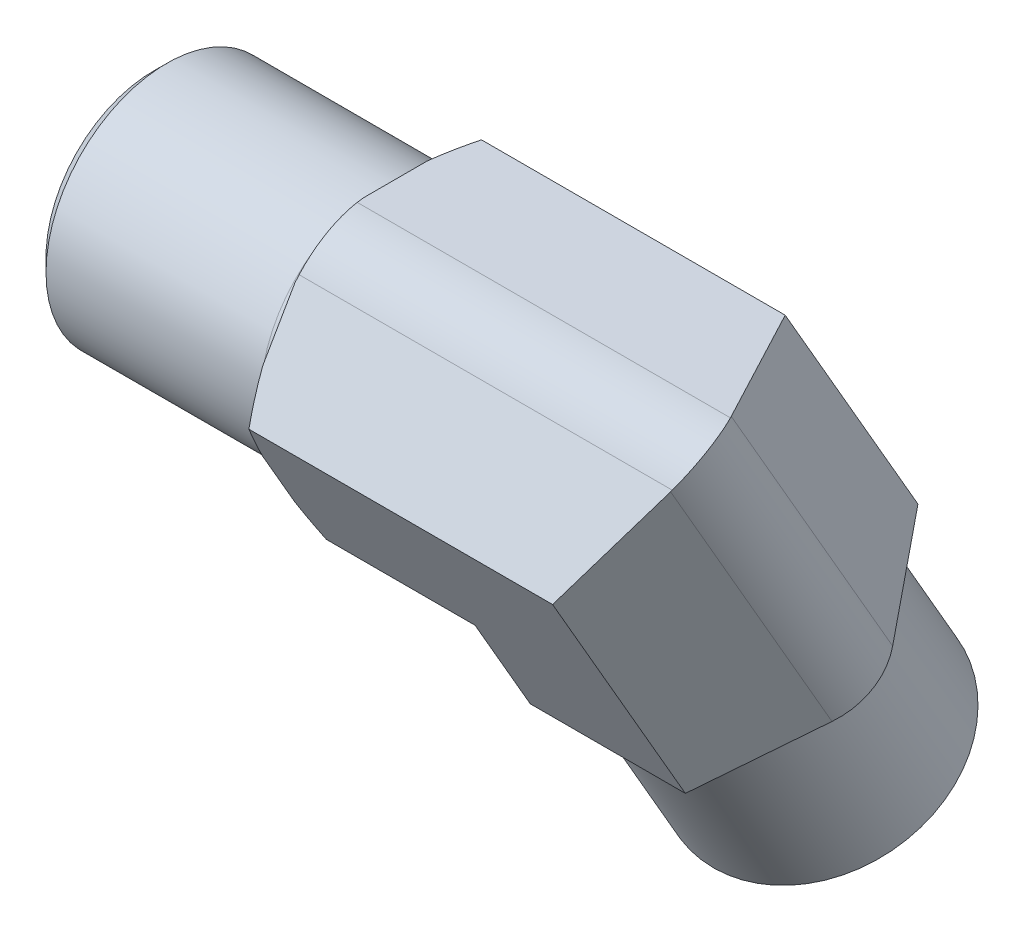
ISO-10303-21;
HEADER;
FILE_DESCRIPTION(('STEP AP214'),'2;1');
FILE_NAME('part.step','',(''),(''),'','','');
FILE_SCHEMA(('AUTOMOTIVE_DESIGN { 1 0 10303 214 1 1 1 1 }'));
ENDSEC;
DATA;
#1=APPLICATION_CONTEXT('core data for automotive mechanical design processes');
#2=APPLICATION_PROTOCOL_DEFINITION('international standard','automotive_design',2000,#1);
#3=PRODUCT_CONTEXT('',#1,'mechanical');
#4=PRODUCT('Part','Part','',(#3));
#5=PRODUCT_RELATED_PRODUCT_CATEGORY('part','',(#4));
#6=PRODUCT_DEFINITION_FORMATION('','',#4);
#7=PRODUCT_DEFINITION_CONTEXT('part definition',#1,'design');
#8=PRODUCT_DEFINITION('design','',#6,#7);
#9=PRODUCT_DEFINITION_SHAPE('','',#8);
#10=(LENGTH_UNIT() NAMED_UNIT(*) SI_UNIT(.MILLI.,.METRE.));
#11=(NAMED_UNIT(*) PLANE_ANGLE_UNIT() SI_UNIT($,.RADIAN.));
#12=(NAMED_UNIT(*) SI_UNIT($,.STERADIAN.) SOLID_ANGLE_UNIT());
#13=UNCERTAINTY_MEASURE_WITH_UNIT(LENGTH_MEASURE(1.E-05),#10,'distance_accuracy_value','');
#14=(GEOMETRIC_REPRESENTATION_CONTEXT(3) GLOBAL_UNCERTAINTY_ASSIGNED_CONTEXT((#13)) GLOBAL_UNIT_ASSIGNED_CONTEXT((#10,
#11,#12)) REPRESENTATION_CONTEXT('',''));
#15=CARTESIAN_POINT('',(0.,0.,0.));
#16=DIRECTION('',(0.,0.,1.));
#17=DIRECTION('',(1.,0.,0.));
#18=AXIS2_PLACEMENT_3D('',#15,#16,#17);
#19=CARTESIAN_POINT('',(17.5,-12.12435565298,-7.));
#20=DIRECTION('',(0.,0.866025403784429,0.500000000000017));
#21=DIRECTION('',(0.,-0.500000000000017,0.866025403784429));
#22=AXIS2_PLACEMENT_3D('',#19,#20,#21);
#23=PLANE('',#22);
#24=CARTESIAN_POINT('',(17.5,-12.124355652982,-6.99999999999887));
#25=DIRECTION('',(0.,0.866025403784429,0.500000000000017));
#26=DIRECTION('',(0.,-0.500000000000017,0.866025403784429));
#27=AXIS2_PLACEMENT_3D('',#24,#25,#26);
#28=CIRCLE('',#27,4.);
#29=CARTESIAN_POINT('',(17.5,-14.1243556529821,-3.53589838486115));
#30=VERTEX_POINT('',#29);
#31=EDGE_CURVE('E864',#30,#30,#28,.F.);
#32=ORIENTED_EDGE('',*,*,#31,.T.);
#33=EDGE_LOOP('',(#32));
#34=FACE_BOUND('',#33,.T.);
#35=ADVANCED_FACE('F16',(#34),#23,.F.);
#36=CARTESIAN_POINT('',(17.5,-25.11473670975,-14.5));
#37=DIRECTION('',(0.,0.866025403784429,0.500000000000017));
#38=DIRECTION('',(0.,-0.500000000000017,0.866025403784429));
#39=AXIS2_PLACEMENT_3D('',#36,#37,#38);
#40=CYLINDRICAL_SURFACE('',#39,4.);
#41=ORIENTED_EDGE('',*,*,#31,.F.);
#42=EDGE_LOOP('',(#41));
#43=FACE_BOUND('',#42,.T.);
#44=CARTESIAN_POINT('',(17.5,-25.114736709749,-14.4999999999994));
#45=DIRECTION('',(0.,0.866025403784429,0.500000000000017));
#46=DIRECTION('',(0.,-0.500000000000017,0.866025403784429));
#47=AXIS2_PLACEMENT_3D('',#44,#45,#46);
#48=CIRCLE('',#47,4.);
#49=CARTESIAN_POINT('',(17.5,-27.114736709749,-11.0358983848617));
#50=VERTEX_POINT('',#49);
#51=EDGE_CURVE('E861',#50,#50,#48,.T.);
#52=ORIENTED_EDGE('',*,*,#51,.F.);
#53=EDGE_LOOP('',(#52));
#54=FACE_BOUND('',#53,.T.);
#55=ADVANCED_FACE('F1165',(#43,#54),#40,.F.);
#56=CARTESIAN_POINT('',(0.,-25.11473670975,-14.5));
#57=DIRECTION('',(0.,-0.866025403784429,-0.500000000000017));
#58=DIRECTION('',(0.,0.500000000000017,-0.866025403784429));
#59=AXIS2_PLACEMENT_3D('',#56,#57,#58);
#60=PLANE('',#59);
#61=ORIENTED_EDGE('',*,*,#51,.T.);
#62=EDGE_LOOP('',(#61));
#63=FACE_BOUND('',#62,.T.);
#64=CARTESIAN_POINT('',(17.5,-25.1147367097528,-14.4999999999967));
#65=DIRECTION('',(0.,0.866025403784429,0.500000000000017));
#66=DIRECTION('',(0.,-0.500000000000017,0.866025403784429));
#67=AXIS2_PLACEMENT_3D('',#64,#65,#66);
#68=CIRCLE('',#67,8.00000000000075);
#69=CARTESIAN_POINT('',(17.5,-29.1147367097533,-7.57179676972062));
#70=VERTEX_POINT('',#69);
#71=EDGE_CURVE('E427',#70,#70,#68,.T.);
#72=ORIENTED_EDGE('',*,*,#71,.F.);
#73=EDGE_LOOP('',(#72));
#74=FACE_BOUND('',#73,.T.);
#75=ADVANCED_FACE('F1158',(#63,#74),#60,.T.);
#76=CARTESIAN_POINT('',(17.5,-24.2487113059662,-13.9999999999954));
#77=DIRECTION('',(0.,0.866025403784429,0.500000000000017));
#78=DIRECTION('',(0.,-0.500000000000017,0.866025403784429));
#79=AXIS2_PLACEMENT_3D('',#76,#77,#78);
#80=CONICAL_SURFACE('',#79,9.00000000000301,0.785398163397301);
#81=CARTESIAN_POINT('',(17.5,-24.2487113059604,-13.9999999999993));
#82=DIRECTION('',(0.,-0.866025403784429,-0.500000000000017));
#83=DIRECTION('',(0.,0.500000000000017,-0.866025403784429));
#84=AXIS2_PLACEMENT_3D('',#81,#82,#83);
#85=CIRCLE('',#84,9.);
#86=CARTESIAN_POINT('',(17.5,-19.7487113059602,-21.7942286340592));
#87=VERTEX_POINT('',#86);
#88=EDGE_CURVE('E199',#87,#87,#85,.F.);
#89=ORIENTED_EDGE('',*,*,#88,.F.);
#90=EDGE_LOOP('',(#89));
#91=FACE_BOUND('',#90,.T.);
#92=ORIENTED_EDGE('',*,*,#71,.T.);
#93=EDGE_LOOP('',(#92));
#94=FACE_BOUND('',#93,.T.);
#95=ADVANCED_FACE('F1153',(#91,#94),#80,.T.);
#96=CARTESIAN_POINT('',(17.5,-12.12435565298,-7.));
#97=DIRECTION('',(0.,-0.866025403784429,-0.500000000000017));
#98=DIRECTION('',(0.,0.500000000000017,-0.866025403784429));
#99=AXIS2_PLACEMENT_3D('',#96,#97,#98);
#100=CYLINDRICAL_SURFACE('',#99,9.);
#101=CARTESIAN_POINT('',(17.5,-12.99038105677,-7.5));
#102=DIRECTION('',(0.,-0.866025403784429,-0.500000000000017));
#103=DIRECTION('',(-0.999940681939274,-0.0054459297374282,0.00943262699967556));
#104=AXIS2_PLACEMENT_3D('',#101,#102,#103);
#105=CIRCLE('',#104,9.);
#106=CARTESIAN_POINT('',(8.50053386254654,-13.0393944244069,-7.41510635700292));
#107=VERTEX_POINT('',#106);
#108=EDGE_CURVE('E267',#107,#107,#105,.T.);
#109=ORIENTED_EDGE('',*,*,#108,.T.);
#110=EDGE_LOOP('',(#109));
#111=FACE_BOUND('',#110,.T.);
#112=ORIENTED_EDGE('',*,*,#88,.T.);
#113=EDGE_LOOP('',(#112));
#114=FACE_BOUND('',#113,.T.);
#115=ADVANCED_FACE('F242',(#111,#114),#100,.T.);
#116=CARTESIAN_POINT('',(0.,-12.12435565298,-7.));
#117=DIRECTION('',(0.,-0.866025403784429,-0.500000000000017));
#118=DIRECTION('',(0.,0.500000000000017,-0.866025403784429));
#119=AXIS2_PLACEMENT_3D('',#116,#117,#118);
#120=PLANE('',#119);
#121=DIRECTION('',(0.5,-0.433012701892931,0.749999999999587));
#122=VECTOR('',#121,1.);
#123=CARTESIAN_POINT('',(7.39637028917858,-13.374355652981,-4.8349364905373));
#124=LINE('',#123,#122);
#125=CARTESIAN_POINT('',(7.39637028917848,-13.3743556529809,-4.83493649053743));
#126=VERTEX_POINT('',#125);
#127=CARTESIAN_POINT('',(8.83974563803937,-14.6243553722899,-2.66987346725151));
#128=VERTEX_POINT('',#127);
#129=EDGE_CURVE('E205',#126,#128,#124,.T.);
#130=ORIENTED_EDGE('',*,*,#129,.F.);
#131=CARTESIAN_POINT('',(11.7264973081,-12.1243556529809,-6.99999999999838));
#132=DIRECTION('',(0.,0.866025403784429,0.500000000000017));
#133=DIRECTION('',(0.,-0.500000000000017,0.866025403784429));
#134=AXIS2_PLACEMENT_3D('',#131,#132,#133);
#135=CIRCLE('',#134,5.);
#136=CARTESIAN_POINT('',(7.39637028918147,-10.8743556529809,-9.16506350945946));
#137=VERTEX_POINT('',#136);
#138=EDGE_CURVE('E189',#137,#126,#135,.T.);
#139=ORIENTED_EDGE('',*,*,#138,.F.);
#140=DIRECTION('',(-0.5,-0.433012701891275,0.750000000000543));
#141=VECTOR('',#140,1.);
#142=CARTESIAN_POINT('',(8.83974554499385,-9.62435601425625,-11.3301263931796));
#143=LINE('',#142,#141);
#144=CARTESIAN_POINT('',(8.83974554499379,-9.62435601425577,-11.3301263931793));
#145=VERTEX_POINT('',#144);
#146=EDGE_CURVE('E183',#145,#137,#143,.T.);
#147=ORIENTED_EDGE('',*,*,#146,.F.);
#148=CARTESIAN_POINT('',(17.5,-12.1243556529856,-6.99999999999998));
#149=DIRECTION('',(0.,-0.866025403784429,-0.500000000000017));
#150=DIRECTION('',(-1.,1.39992184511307E-13,-2.42427605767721E-13));
#151=AXIS2_PLACEMENT_3D('',#148,#149,#150);
#152=CIRCLE('',#151,10.0000000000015);
#153=CARTESIAN_POINT('',(7.49999999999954,-12.1243556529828,-7.00000000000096));
#154=VERTEX_POINT('',#153);
#155=EDGE_CURVE('E228',#145,#154,#152,.F.);
#156=ORIENTED_EDGE('',*,*,#155,.T.);
#157=CARTESIAN_POINT('',(8.83974563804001,-14.6243553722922,-2.66987346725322));
#158=CARTESIAN_POINT('',(8.80337978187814,-14.5928539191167,-2.72443558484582));
#159=CARTESIAN_POINT('',(8.76769753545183,-14.5611551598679,-2.77933944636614));
#160=CARTESIAN_POINT('',(8.69771696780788,-14.497378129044,-2.88980450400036));
#161=CARTESIAN_POINT('',(8.66341864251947,-14.4652998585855,-2.94536569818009));
#162=CARTESIAN_POINT('',(8.59622241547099,-14.4007787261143,-3.05711957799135));
#163=CARTESIAN_POINT('',(8.56332451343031,-14.3683358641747,-3.11331226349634));
#164=CARTESIAN_POINT('',(8.49894289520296,-14.3031010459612,-3.22630228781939));
#165=CARTESIAN_POINT('',(8.46745918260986,-14.2703090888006,-3.28309962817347));
#166=CARTESIAN_POINT('',(8.40592674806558,-14.2043902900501,-3.39727434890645));
#167=CARTESIAN_POINT('',(8.3758780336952,-14.1712634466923,-3.45465173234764));
#168=CARTESIAN_POINT('',(8.31720703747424,-14.1046946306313,-3.56995234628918));
#169=CARTESIAN_POINT('',(8.28858476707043,-14.0712526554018,-3.62787558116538));
#170=CARTESIAN_POINT('',(8.24472712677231,-14.0183597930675,-3.71948873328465));
#171=CARTESIAN_POINT('',(8.22898080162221,-13.9990144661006,-3.75299582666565));
#172=CARTESIAN_POINT('',(8.186564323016,-13.9459309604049,-3.84493915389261));
#173=CARTESIAN_POINT('',(8.16039561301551,-13.9120923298,-3.90354936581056));
#174=CARTESIAN_POINT('',(8.0987543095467,-13.8297218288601,-4.04621922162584));
#175=CARTESIAN_POINT('',(8.06404455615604,-13.7810468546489,-4.13052672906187));
#176=CARTESIAN_POINT('',(7.99843498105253,-13.6843209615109,-4.29806085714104));
#177=CARTESIAN_POINT('',(7.96746528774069,-13.6362818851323,-4.38126696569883));
#178=CARTESIAN_POINT('',(7.91665561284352,-13.5531885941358,-4.52518875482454));
#179=CARTESIAN_POINT('',(7.89611666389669,-13.5182409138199,-4.58571991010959));
#180=CARTESIAN_POINT('',(7.86418616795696,-13.4616475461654,-4.68374249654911));
#181=CARTESIAN_POINT('',(7.8523210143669,-13.4400683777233,-4.72111871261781));
#182=CARTESIAN_POINT('',(7.82192782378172,-13.3833269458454,-4.8193977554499));
#183=CARTESIAN_POINT('',(7.80386845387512,-13.3481015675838,-4.88040990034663));
#184=CARTESIAN_POINT('',(7.76928777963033,-13.2774628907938,-5.00275967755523));
#185=CARTESIAN_POINT('',(7.75276647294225,-13.2420495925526,-5.06409730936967));
#186=CARTESIAN_POINT('',(7.72126422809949,-13.1710520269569,-5.18706870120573));
#187=CARTESIAN_POINT('',(7.70628329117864,-13.1354677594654,-5.2487024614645));
#188=CARTESIAN_POINT('',(7.67786995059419,-13.0641449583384,-5.37223718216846));
#189=CARTESIAN_POINT('',(7.66443755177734,-13.0284064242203,-5.43413814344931));
#190=CARTESIAN_POINT('',(7.63912846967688,-12.9567914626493,-5.55817890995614));
#191=CARTESIAN_POINT('',(7.62725179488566,-12.9209150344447,-5.62031871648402));
#192=CARTESIAN_POINT('',(7.60781066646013,-12.8579651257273,-5.72935118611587));
#193=CARTESIAN_POINT('',(7.59990768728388,-12.8309175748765,-5.77619893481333));
#194=CARTESIAN_POINT('',(7.58007549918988,-12.7588937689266,-5.90094787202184));
#195=CARTESIAN_POINT('',(7.56893015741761,-12.7138627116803,-5.97894398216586));
#196=CARTESIAN_POINT('',(7.55110099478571,-12.6326354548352,-6.11963374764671));
#197=CARTESIAN_POINT('',(7.54397070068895,-12.5964634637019,-6.18228547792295));
#198=CARTESIAN_POINT('',(7.53130817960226,-12.5240496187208,-6.30770992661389));
#199=CARTESIAN_POINT('',(7.5257759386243,-12.4878077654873,-6.37048264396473));
#200=CARTESIAN_POINT('',(7.51631618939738,-12.4152724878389,-6.49611739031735));
#201=CARTESIAN_POINT('',(7.51238865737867,-12.3789790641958,-6.55897941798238));
#202=CARTESIAN_POINT('',(7.5061294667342,-12.3063581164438,-6.68476253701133));
#203=CARTESIAN_POINT('',(7.5037977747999,-12.2700305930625,-6.74768362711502));
#204=CARTESIAN_POINT('',(7.50152199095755,-12.2154034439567,-6.84230060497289));
#205=CARTESIAN_POINT('',(7.50096724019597,-12.1971096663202,-6.87398635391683));
#206=CARTESIAN_POINT('',(7.50022519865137,-12.1606624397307,-6.93711479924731));
#207=CARTESIAN_POINT('',(7.50003508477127,-12.1425090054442,-6.96855747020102));
#208=CARTESIAN_POINT('',(7.5,-12.1243556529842,-7.00000000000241));
#209=B_SPLINE_CURVE_WITH_KNOTS('',3,(#157,#158,#159,#160,#161,#162,#163,#164,#165,#166,#167,
#168,#169,#170,#171,#172,#173,#174,#175,#176,#177,#178,#179,#180,#181,#182,#183,#184,#185,#186,
#187,#188,#189,#190,#191,#192,#193,#194,#195,#196,#197,#198,#199,#200,#201,#202,#203,#204,#205,
#206,#207,#208),.UNSPECIFIED.,.F.,.F.,(4,2,2,2,2,2,2,2,2,2,2,2,2,2,2,2,2,2,2,2,2,2,2,2,2,4),(0.,
0.218230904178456,0.43646116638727,0.654691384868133,0.87292215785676,1.09115408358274,
1.30938776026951,1.43470135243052,1.65236483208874,1.96237132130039,2.26516260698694,
2.48369693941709,2.61797261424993,2.83614005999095,3.05430717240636,3.27247445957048,
3.49064242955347,3.70881159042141,3.8728138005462,4.14502266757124,4.36308983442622,
4.58115509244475,4.79921712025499,5.0172745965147,5.12704817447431,5.23596837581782),.UNSPECIFIED.);
#210=EDGE_CURVE('E198',#154,#128,#209,.F.);
#211=ORIENTED_EDGE('',*,*,#210,.T.);
#212=EDGE_LOOP('',(#130,#139,#147,#156,#211));
#213=FACE_BOUND('',#212,.T.);
#214=ADVANCED_FACE('F212',(#213),#120,.T.);
#215=CARTESIAN_POINT('',(11.7264973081,-86.07497694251,-49.69541110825));
#216=DIRECTION('',(0.,0.866025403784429,0.500000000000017));
#217=DIRECTION('',(0.,-0.500000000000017,0.866025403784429));
#218=AXIS2_PLACEMENT_3D('',#215,#216,#217);
#219=CYLINDRICAL_SURFACE('',#218,5.);
#220=DIRECTION('',(-1.32228929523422E-13,0.866025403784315,0.500000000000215));
#221=VECTOR('',#220,1.);
#222=CARTESIAN_POINT('',(7.39637028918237,-10.8743556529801,-9.16506350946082));
#223=LINE('',#222,#221);
#224=CARTESIAN_POINT('',(7.39637028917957,-7.49999999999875,-7.21687836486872));
#225=VERTEX_POINT('',#224);
#226=EDGE_CURVE('E195',#137,#225,#223,.T.);
#227=ORIENTED_EDGE('',*,*,#226,.F.);
#228=ORIENTED_EDGE('',*,*,#138,.T.);
#229=DIRECTION('',(-1.31783714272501E-13,-0.866025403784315,-0.500000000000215));
#230=VECTOR('',#229,1.);
#231=CARTESIAN_POINT('',(7.3963702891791,-10.0000000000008,-2.88675134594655));
#232=LINE('',#231,#230);
#233=CARTESIAN_POINT('',(7.39637028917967,-10.,-2.88675134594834));
#234=VERTEX_POINT('',#233);
#235=EDGE_CURVE('E193',#234,#126,#232,.T.);
#236=ORIENTED_EDGE('',*,*,#235,.F.);
#237=CARTESIAN_POINT('',(11.7264973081,-5.0000000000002,-2.88675134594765));
#238=DIRECTION('',(-0.707106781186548,0.612372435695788,0.353553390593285));
#239=DIRECTION('',(0.707106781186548,0.612372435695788,0.353553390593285));
#240=AXIS2_PLACEMENT_3D('',#237,#238,#239);
#241=ELLIPSE('',#240,7.07106781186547,5.);
#242=EDGE_CURVE('E218',#225,#234,#241,.T.);
#243=ORIENTED_EDGE('',*,*,#242,.F.);
#244=EDGE_LOOP('',(#227,#228,#236,#243));
#245=FACE_BOUND('',#244,.T.);
#246=ADVANCED_FACE('F191',(#245),#219,.T.);
#247=CARTESIAN_POINT('',(17.5,-12.99038105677,-7.5));
#248=DIRECTION('',(0.,-0.866025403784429,-0.500000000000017));
#249=DIRECTION('',(-0.999940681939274,-0.00544592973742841,0.00943262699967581));
#250=AXIS2_PLACEMENT_3D('',#247,#248,#249);
#251=TOROIDAL_SURFACE('',#250,10.,1.);
#252=ORIENTED_EDGE('',*,*,#108,.F.);
#253=EDGE_LOOP('',(#252));
#254=FACE_BOUND('',#253,.T.);
#255=CARTESIAN_POINT('',(17.5,-12.1243556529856,-6.99999999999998));
#256=DIRECTION('',(0.,-0.866025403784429,-0.500000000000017));
#257=DIRECTION('',(-7.93120003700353E-08,0.500000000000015,-0.866025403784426));
#258=AXIS2_PLACEMENT_3D('',#255,#256,#257);
#259=CIRCLE('',#258,10.);
#260=CARTESIAN_POINT('',(27.4999999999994,-12.1243556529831,-7.00000000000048));
#261=VERTEX_POINT('',#260);
#262=CARTESIAN_POINT('',(17.49999920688,-7.1243556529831,-15.6602540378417));
#263=VERTEX_POINT('',#262);
#264=EDGE_CURVE('E289',#261,#263,#259,.F.);
#265=ORIENTED_EDGE('',*,*,#264,.F.);
#266=CARTESIAN_POINT('',(27.5,-12.1243556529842,-7.00000000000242));
#267=CARTESIAN_POINT('',(27.5000034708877,-12.2061680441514,-6.85829678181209));
#268=CARTESIAN_POINT('',(27.495984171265,-12.2879802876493,-6.71659381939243));
#269=CARTESIAN_POINT('',(27.4799249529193,-12.4514077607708,-6.43352913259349));
#270=CARTESIAN_POINT('',(27.4678850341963,-12.5330229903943,-6.2921674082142));
#271=CARTESIAN_POINT('',(27.4358094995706,-12.6958597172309,-6.01012592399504));
#272=CARTESIAN_POINT('',(27.4157738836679,-12.777081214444,-5.86944616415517));
#273=CARTESIAN_POINT('',(27.3677563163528,-12.9389348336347,-5.58910747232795));
#274=CARTESIAN_POINT('',(27.3397743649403,-13.0195669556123,-5.4494485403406));
#275=CARTESIAN_POINT('',(27.2759312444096,-13.1800475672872,-5.17148796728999));
#276=CARTESIAN_POINT('',(27.2400700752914,-13.2598960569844,-5.03318632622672));
#277=CARTESIAN_POINT('',(27.1605549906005,-13.4186170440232,-4.75827351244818));
#278=CARTESIAN_POINT('',(27.1169010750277,-13.4974895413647,-4.6216623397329));
#279=CARTESIAN_POINT('',(27.0219056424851,-13.6540685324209,-4.35045957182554));
#280=CARTESIAN_POINT('',(26.9705641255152,-13.7317750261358,-4.21586797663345));
#281=CARTESIAN_POINT('',(26.8603171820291,-13.8858348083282,-3.94902860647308));
#282=CARTESIAN_POINT('',(26.801411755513,-13.9621880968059,-3.81678083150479));
#283=CARTESIAN_POINT('',(26.6761788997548,-14.1133575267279,-3.55494769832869));
#284=CARTESIAN_POINT('',(26.6098514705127,-14.1881736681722,-3.42536234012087));
#285=CARTESIAN_POINT('',(26.4699343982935,-14.3360885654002,-3.16916622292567));
#286=CARTESIAN_POINT('',(26.3963447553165,-14.4091873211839,-3.0425554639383));
#287=CARTESIAN_POINT('',(26.242080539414,-14.5534913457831,-2.79261356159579));
#288=CARTESIAN_POINT('',(26.1614059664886,-14.6246966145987,-2.66928241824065));
#289=CARTESIAN_POINT('',(25.9931662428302,-14.7650421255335,-2.42619686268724));
#290=CARTESIAN_POINT('',(25.9056010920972,-14.8341823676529,-2.30644245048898));
#291=CARTESIAN_POINT('',(25.7237911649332,-14.9702312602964,-2.07079885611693));
#292=CARTESIAN_POINT('',(25.6295463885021,-15.0371399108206,-1.95490967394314));
#293=CARTESIAN_POINT('',(25.4346042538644,-15.1685644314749,-1.72727572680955));
#294=CARTESIAN_POINT('',(25.3339068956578,-15.2330803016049,-1.61553096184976));
#295=CARTESIAN_POINT('',(25.1263021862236,-15.3595638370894,-1.39645505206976));
#296=CARTESIAN_POINT('',(25.0193948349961,-15.4215315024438,-1.28912390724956));
#297=CARTESIAN_POINT('',(24.7996276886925,-15.5427693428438,-1.07913380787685));
#298=CARTESIAN_POINT('',(24.6867678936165,-15.6020395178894,-0.976474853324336));
#299=CARTESIAN_POINT('',(24.4553677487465,-15.7177395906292,-0.776076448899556));
#300=CARTESIAN_POINT('',(24.3368273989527,-15.7741694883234,-0.67833699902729));
#301=CARTESIAN_POINT('',(24.0943517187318,-15.8840530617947,-0.488013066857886));
#302=CARTESIAN_POINT('',(23.9704163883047,-15.9375067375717,-0.395428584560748));
#303=CARTESIAN_POINT('',(23.7174493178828,-16.041309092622,-0.215637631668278));
#304=CARTESIAN_POINT('',(23.588417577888,-16.0916577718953,-0.128431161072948));
#305=CARTESIAN_POINT('',(23.3255685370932,-16.1891288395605,0.0403936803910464));
#306=CARTESIAN_POINT('',(23.1917512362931,-16.2362512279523,0.12201205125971));
#307=CARTESIAN_POINT('',(22.9196534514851,-16.3271561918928,0.279464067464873));
#308=CARTESIAN_POINT('',(22.7813729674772,-16.3709387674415,0.355297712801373));
#309=CARTESIAN_POINT('',(22.5006819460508,-16.4550586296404,0.50099758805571));
#310=CARTESIAN_POINT('',(22.3582714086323,-16.4953959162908,0.570863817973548));
#311=CARTESIAN_POINT('',(22.0696633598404,-16.5725280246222,0.704460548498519));
#312=CARTESIAN_POINT('',(21.923465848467,-16.6093228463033,0.768191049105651));
#313=CARTESIAN_POINT('',(21.6276360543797,-16.6792813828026,0.889362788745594));
#314=CARTESIAN_POINT('',(21.4780037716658,-16.7124450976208,0.946804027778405));
#315=CARTESIAN_POINT('',(21.1756649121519,-16.7750615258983,1.0552588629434));
#316=CARTESIAN_POINT('',(21.0229583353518,-16.8045142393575,1.10627245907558));
#317=CARTESIAN_POINT('',(20.7148387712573,-16.8596377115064,1.20174911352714));
#318=CARTESIAN_POINT('',(20.559425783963,-16.8853084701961,1.24621217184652));
#319=CARTESIAN_POINT('',(20.2462678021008,-16.93280618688,1.32848063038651));
#320=CARTESIAN_POINT('',(20.0885228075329,-16.9546331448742,1.36628603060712));
#321=CARTESIAN_POINT('',(19.771080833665,-16.9943906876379,1.43514811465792));
#322=CARTESIAN_POINT('',(19.6113838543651,-17.0123212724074,1.46620479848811));
#323=CARTESIAN_POINT('',(19.2904226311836,-17.0442428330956,1.52149456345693));
#324=CARTESIAN_POINT('',(19.1291583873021,-17.0582338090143,1.54572764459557));
#325=CARTESIAN_POINT('',(18.8054511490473,-17.0822425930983,1.58731207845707));
#326=CARTESIAN_POINT('',(18.643008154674,-17.0922604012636,1.60466343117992));
#327=CARTESIAN_POINT('',(18.3173347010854,-17.1082981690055,1.63244165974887));
#328=CARTESIAN_POINT('',(18.1541042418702,-17.1143181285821,1.64286853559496));
#329=CARTESIAN_POINT('',(17.8272492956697,-17.1223477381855,1.65677622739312));
#330=CARTESIAN_POINT('',(17.6636248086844,-17.1243573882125,1.66025704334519));
#331=CARTESIAN_POINT('',(17.50000002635,-17.1243556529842,1.6602540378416));
#332=B_SPLINE_CURVE_WITH_KNOTS('',3,(#266,#267,#268,#269,#270,#271,#272,#273,#274,#275,#276,
#277,#278,#279,#280,#281,#282,#283,#284,#285,#286,#287,#288,#289,#290,#291,#292,#293,#294,#295,
#296,#297,#298,#299,#300,#301,#302,#303,#304,#305,#306,#307,#308,#309,#310,#311,#312,#313,#314,
#315,#316,#317,#318,#319,#320,#321,#322,#323,#324,#325,#326,#327,#328,#329,#330,#331),
.UNSPECIFIED.,.F.,.F.,(4,2,2,2,2,2,2,2,2,2,2,2,2,2,2,2,2,2,2,2,2,2,2,2,2,2,2,2,2,2,2,2,4),(0.,
0.490824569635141,0.981649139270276,1.4724737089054,1.96329827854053,2.45412284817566,
2.94494741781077,3.43577198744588,3.92659655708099,4.41742112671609,4.90824569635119,
5.39907026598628,5.88989483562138,6.38071940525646,6.87154397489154,7.36236854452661,
7.85319311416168,8.34401768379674,8.83484225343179,9.32566682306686,9.8164913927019,
10.3073159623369,10.798140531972,11.288965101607,11.7797896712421,12.2706142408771,
12.7614388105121,13.2522633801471,13.7430879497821,14.2339125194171,14.7247370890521,
15.2155616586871,15.7063862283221),.UNSPECIFIED.);
#333=CARTESIAN_POINT('',(17.50000002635,-17.1243556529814,1.66025403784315));
#334=VERTEX_POINT('',#333);
#335=EDGE_CURVE('E290',#334,#261,#332,.F.);
#336=ORIENTED_EDGE('',*,*,#335,.F.);
#337=CARTESIAN_POINT('',(17.50000002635,-17.1243556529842,1.6602540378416));
#338=CARTESIAN_POINT('',(17.4047637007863,-17.1243508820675,1.66024577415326));
#339=CARTESIAN_POINT('',(17.3095275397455,-17.1236677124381,1.6590624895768));
#340=CARTESIAN_POINT('',(17.1191329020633,-17.1209459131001,1.6543481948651));
#341=CARTESIAN_POINT('',(17.023974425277,-17.1189072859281,1.65081718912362));
#342=CARTESIAN_POINT('',(16.8338120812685,-17.1134759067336,1.64140976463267));
#343=CARTESIAN_POINT('',(16.7388082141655,-17.1100831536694,1.63553334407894));
#344=CARTESIAN_POINT('',(16.5490319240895,-17.1019467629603,1.62144069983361));
#345=CARTESIAN_POINT('',(16.4542595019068,-17.097203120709,1.61322446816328));
#346=CARTESIAN_POINT('',(16.2650225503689,-17.0863671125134,1.59445594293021));
#347=CARTESIAN_POINT('',(16.17055802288,-17.0802747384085,1.58390363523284));
#348=CARTESIAN_POINT('',(15.9935568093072,-17.0675802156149,1.56191605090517));
#349=CARTESIAN_POINT('',(15.9109757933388,-17.0611318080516,1.55074706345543));
#350=CARTESIAN_POINT('',(15.723075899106,-17.0452376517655,1.52321754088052));
#351=CARTESIAN_POINT('',(15.6178690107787,-17.0354583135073,1.506279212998));
#352=CARTESIAN_POINT('',(15.4195896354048,-17.0153523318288,1.47145464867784));
#353=CARTESIAN_POINT('',(15.3264455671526,-17.0052018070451,1.45387345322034));
#354=CARTESIAN_POINT('',(15.1578557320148,-16.9855090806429,1.41976469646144));
#355=CARTESIAN_POINT('',(15.0823018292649,-16.9761976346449,1.4036368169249));
#356=CARTESIAN_POINT('',(14.9528037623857,-16.9595024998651,1.37472000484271));
#357=CARTESIAN_POINT('',(14.8987586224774,-16.9523132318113,1.36226782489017));
#358=CARTESIAN_POINT('',(14.7376277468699,-16.9301531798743,1.3238854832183));
#359=CARTESIAN_POINT('',(14.6309062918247,-16.9145135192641,1.2967967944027));
#360=CARTESIAN_POINT('',(14.4075058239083,-16.8797493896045,1.23658353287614));
#361=CARTESIAN_POINT('',(14.2909471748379,-16.8604316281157,1.20312416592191));
#362=CARTESIAN_POINT('',(14.0684599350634,-16.8212598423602,1.13527659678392));
#363=CARTESIAN_POINT('',(13.9624171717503,-16.8015678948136,1.101169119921));
#364=CARTESIAN_POINT('',(13.7674517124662,-16.7634519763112,1.03515039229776));
#365=CARTESIAN_POINT('',(13.6783341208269,-16.7452768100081,1.00367008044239));
#366=CARTESIAN_POINT('',(13.4967793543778,-16.7067031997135,0.936858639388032));
#367=CARTESIAN_POINT('',(13.4043979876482,-16.6862391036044,0.901413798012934));
#368=CARTESIAN_POINT('',(13.2004710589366,-16.6391904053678,0.819923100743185));
#369=CARTESIAN_POINT('',(13.0892447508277,-16.6122584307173,0.773275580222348));
#370=CARTESIAN_POINT('',(12.9147275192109,-16.5679891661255,0.69659899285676));
#371=CARTESIAN_POINT('',(12.8507506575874,-16.551323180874,0.667732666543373));
#372=CARTESIAN_POINT('',(12.7053668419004,-16.5124562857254,0.600413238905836));
#373=CARTESIAN_POINT('',(12.6241966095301,-16.4900332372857,0.56157538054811));
#374=CARTESIAN_POINT('',(12.4569663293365,-16.4423166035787,0.478927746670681));
#375=CARTESIAN_POINT('',(12.3710072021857,-16.4169346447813,0.434964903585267));
#376=CARTESIAN_POINT('',(12.1945827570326,-16.3630529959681,0.341639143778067));
#377=CARTESIAN_POINT('',(12.1042313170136,-16.3344599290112,0.292114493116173));
#378=CARTESIAN_POINT('',(11.9610578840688,-16.2875349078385,0.210837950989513));
#379=CARTESIAN_POINT('',(11.9076374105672,-16.2696578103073,0.179873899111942));
#380=CARTESIAN_POINT('',(11.8198633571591,-16.2396681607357,0.127930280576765));
#381=CARTESIAN_POINT('',(11.7853095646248,-16.227701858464,0.107204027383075));
#382=CARTESIAN_POINT('',(11.6706406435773,-16.187450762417,0.0374870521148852));
#383=CARTESIAN_POINT('',(11.591203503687,-16.1586805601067,-0.0123444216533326));
#384=CARTESIAN_POINT('',(11.4340648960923,-16.0999797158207,-0.114017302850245));
#385=CARTESIAN_POINT('',(11.3563634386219,-16.0700490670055,-0.165858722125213));
#386=CARTESIAN_POINT('',(11.2027628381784,-16.0090525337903,-0.271507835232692));
#387=CARTESIAN_POINT('',(11.1268636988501,-15.9779866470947,-0.325315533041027));
#388=CARTESIAN_POINT('',(10.9769347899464,-15.9147471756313,-0.434849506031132));
#389=CARTESIAN_POINT('',(10.9029050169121,-15.8825735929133,-0.490575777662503));
#390=CARTESIAN_POINT('',(10.7567794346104,-15.8171468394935,-0.603898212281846));
#391=CARTESIAN_POINT('',(10.6846836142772,-15.7838936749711,-0.661494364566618));
#392=CARTESIAN_POINT('',(10.5424900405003,-15.7163371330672,-0.778505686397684));
#393=CARTESIAN_POINT('',(10.4723922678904,-15.6820337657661,-0.837920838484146));
#394=CARTESIAN_POINT('',(10.3342530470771,-15.6124062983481,-0.95851910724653));
#395=CARTESIAN_POINT('',(10.2662115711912,-15.5770822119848,-1.01970220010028));
#396=CARTESIAN_POINT('',(10.1800963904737,-15.5310301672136,-1.09946666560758));
#397=CARTESIAN_POINT('',(10.1610461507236,-15.5207558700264,-1.11726226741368));
#398=CARTESIAN_POINT('',(10.0961002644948,-15.4854345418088,-1.17844059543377));
#399=CARTESIAN_POINT('',(10.0506237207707,-15.4601942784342,-1.22215801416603));
#400=CARTESIAN_POINT('',(9.94270449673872,-15.3990778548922,-1.32801476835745));
#401=CARTESIAN_POINT('',(9.88075080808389,-15.3629853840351,-1.39052876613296));
#402=CARTESIAN_POINT('',(9.75891497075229,-15.2899386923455,-1.51704933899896));
#403=CARTESIAN_POINT('',(9.69903281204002,-15.252984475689,-1.58105590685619));
#404=CARTESIAN_POINT('',(9.57290427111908,-15.1729299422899,-1.7197144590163));
#405=CARTESIAN_POINT('',(9.50697077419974,-15.1297057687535,-1.79458097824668));
#406=CARTESIAN_POINT('',(9.41826911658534,-15.0693943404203,-1.89904344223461));
#407=CARTESIAN_POINT('',(9.3941831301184,-15.0527885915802,-1.92780543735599));
#408=CARTESIAN_POINT('',(9.28739457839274,-14.9782007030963,-2.05699542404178));
#409=CARTESIAN_POINT('',(9.20695851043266,-14.9193984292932,-2.15884392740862));
#410=CARTESIAN_POINT('',(9.07230343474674,-14.8163019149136,-2.33741230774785));
#411=CARTESIAN_POINT('',(9.01688818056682,-14.7723957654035,-2.4134599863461));
#412=CARTESIAN_POINT('',(8.92098674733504,-14.6937467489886,-2.54968407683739));
#413=CARTESIAN_POINT('',(8.87995251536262,-14.6591708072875,-2.60957136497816));
#414=CARTESIAN_POINT('',(8.83974563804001,-14.6243553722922,-2.66987346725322));
#415=B_SPLINE_CURVE_WITH_KNOTS('',3,(#337,#338,#339,#340,#341,#342,#343,#344,#345,#346,#347,
#348,#349,#350,#351,#352,#353,#354,#355,#356,#357,#358,#359,#360,#361,#362,#363,#364,#365,#366,
#367,#368,#369,#370,#371,#372,#373,#374,#375,#376,#377,#378,#379,#380,#381,#382,#383,#384,#385,
#386,#387,#388,#389,#390,#391,#392,#393,#394,#395,#396,#397,#398,#399,#400,#401,#402,#403,#404,
#405,#406,#407,#408,#409,#410,#411,#412,#413,#414),.UNSPECIFIED.,.F.,.F.,(4,2,2,2,2,2,2,2,2,2,2,
2,2,2,2,2,2,2,2,2,2,2,2,2,2,2,2,2,2,2,2,2,2,2,2,2,2,2,4),(0.,0.285699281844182,
0.571398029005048,0.857096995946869,1.14279693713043,1.42849860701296,1.67922036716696,
2.00018941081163,2.28614000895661,2.51956440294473,2.68733448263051,3.02090056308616,
3.3892024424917,3.72849584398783,4.01719381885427,4.32027456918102,4.69092632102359,
4.90733044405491,5.1854980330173,5.48494407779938,5.80567012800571,5.99850326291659,
6.12459839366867,6.41881352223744,6.71303038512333,7.00724784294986,7.30146475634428,
7.59567998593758,7.88989239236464,8.18410083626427,8.26816231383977,8.47198050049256,
8.75731755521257,9.04265322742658,9.36875048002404,9.49182744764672,9.91911488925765,
10.2305761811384,10.4717851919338),.UNSPECIFIED.);
#416=EDGE_CURVE('E301',#128,#334,#415,.F.);
#417=ORIENTED_EDGE('',*,*,#416,.F.);
#418=ORIENTED_EDGE('',*,*,#210,.F.);
#419=ORIENTED_EDGE('',*,*,#155,.F.);
#420=CARTESIAN_POINT('',(17.5,-12.1243556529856,-6.99999999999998));
#421=DIRECTION('',(0.,-0.866025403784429,-0.500000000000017));
#422=DIRECTION('',(-0.866025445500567,0.249999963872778,-0.433012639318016));
#423=AXIS2_PLACEMENT_3D('',#420,#421,#422);
#424=CIRCLE('',#423,9.99999999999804);
#425=EDGE_CURVE('E262',#263,#145,#424,.F.);
#426=ORIENTED_EDGE('',*,*,#425,.F.);
#427=EDGE_LOOP('',(#265,#336,#417,#418,#419,#426));
#428=FACE_BOUND('',#427,.T.);
#429=ADVANCED_FACE('F269',(#254,#428),#251,.F.);
#430=CARTESIAN_POINT('',(23.52534144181,73.15977077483,42.2388133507));
#431=DIRECTION('',(0.,-0.866025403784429,-0.500000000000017));
#432=DIRECTION('',(0.,0.500000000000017,-0.866025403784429));
#433=AXIS2_PLACEMENT_3D('',#430,#431,#432);
#434=CYLINDRICAL_SURFACE('',#433,5.);
#435=CARTESIAN_POINT('',(23.52534144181,-12.1243556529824,-7.00000000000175));
#436=DIRECTION('',(0.,-0.866025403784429,-0.500000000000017));
#437=DIRECTION('',(0.,0.500000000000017,-0.866025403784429));
#438=AXIS2_PLACEMENT_3D('',#435,#436,#437);
#439=CIRCLE('',#438,5.);
#440=CARTESIAN_POINT('',(27.7916334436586,-10.8206347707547,-9.25811080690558));
#441=VERTEX_POINT('',#440);
#442=CARTESIAN_POINT('',(27.7916334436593,-13.4280765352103,-4.74188919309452));
#443=VERTEX_POINT('',#442);
#444=EDGE_CURVE('E299',#441,#443,#439,.T.);
#445=ORIENTED_EDGE('',*,*,#444,.F.);
#446=DIRECTION('',(0.,-0.866025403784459,-0.499999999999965));
#447=VECTOR('',#446,1.);
#448=CARTESIAN_POINT('',(27.79163344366,10.,2.76268828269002));
#449=LINE('',#448,#447);
#450=CARTESIAN_POINT('',(27.7916334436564,10.,2.76268828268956));
#451=VERTEX_POINT('',#450);
#452=EDGE_CURVE('E216',#451,#441,#449,.T.);
#453=ORIENTED_EDGE('',*,*,#452,.F.);
#454=CARTESIAN_POINT('',(23.52534144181,10.,5.77350269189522));
#455=DIRECTION('',(0.,1.,0.));
#456=DIRECTION('',(0.,0.,-1.));
#457=AXIS2_PLACEMENT_3D('',#454,#455,#456);
#458=ELLIPSE('',#457,5.77350269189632,5.);
#459=CARTESIAN_POINT('',(27.8554684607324,10.,2.88675134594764));
#460=VERTEX_POINT('',#459);
#461=EDGE_CURVE('E857',#451,#460,#458,.F.);
#462=ORIENTED_EDGE('',*,*,#461,.T.);
#463=CARTESIAN_POINT('',(23.52534144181,5.00000000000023,2.88675134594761));
#464=DIRECTION('',(-0.707106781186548,0.612372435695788,0.353553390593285));
#465=DIRECTION('',(-0.707106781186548,-0.612372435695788,-0.353553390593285));
#466=AXIS2_PLACEMENT_3D('',#463,#464,#465);
#467=ELLIPSE('',#466,7.07106781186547,5.);
#468=CARTESIAN_POINT('',(27.8554684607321,7.50000000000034,7.21687836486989));
#469=VERTEX_POINT('',#468);
#470=EDGE_CURVE('E514',#469,#460,#467,.T.);
#471=ORIENTED_EDGE('',*,*,#470,.F.);
#472=CARTESIAN_POINT('',(23.52534144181,10.0000000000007,5.77350269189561));
#473=DIRECTION('',(0.,0.500000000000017,0.866025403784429));
#474=DIRECTION('',(0.,-0.866025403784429,0.500000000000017));
#475=AXIS2_PLACEMENT_3D('',#472,#473,#474);
#476=ELLIPSE('',#475,5.77350269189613,5.);
#477=CARTESIAN_POINT('',(27.791633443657,7.39255823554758,7.27890989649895));
#478=VERTEX_POINT('',#477);
#479=EDGE_CURVE('E442',#469,#478,#476,.F.);
#480=ORIENTED_EDGE('',*,*,#479,.T.);
#481=DIRECTION('',(0.,0.866025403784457,0.499999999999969));
#482=VECTOR('',#481,1.);
#483=CARTESIAN_POINT('',(27.7916334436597,-13.4280765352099,-4.74188919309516));
#484=LINE('',#483,#482);
#485=EDGE_CURVE('E286',#443,#478,#484,.T.);
#486=ORIENTED_EDGE('',*,*,#485,.F.);
#487=EDGE_LOOP('',(#445,#453,#462,#471,#480,#486));
#488=FACE_BOUND('',#487,.T.);
#489=ADVANCED_FACE('F279',(#488),#434,.T.);
#490=CARTESIAN_POINT('',(0.,-12.12435565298,-7.));
#491=DIRECTION('',(0.,-0.866025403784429,-0.500000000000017));
#492=DIRECTION('',(0.,0.500000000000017,-0.866025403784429));
#493=AXIS2_PLACEMENT_3D('',#490,#491,#492);
#494=PLANE('',#493);
#495=DIRECTION('',(1.,0.,0.));
#496=VECTOR('',#495,1.);
#497=CARTESIAN_POINT('',(0.,-7.12435565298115,-15.6602540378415));
#498=LINE('',#497,#496);
#499=CARTESIAN_POINT('',(11.7264973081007,-7.12435565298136,-15.6602540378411));
#500=VERTEX_POINT('',#499);
#501=EDGE_CURVE('E441',#263,#500,#498,.F.);
#502=ORIENTED_EDGE('',*,*,#501,.F.);
#503=ORIENTED_EDGE('',*,*,#425,.T.);
#504=DIRECTION('',(-0.5,-0.433012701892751,0.74999999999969));
#505=VECTOR('',#504,1.);
#506=CARTESIAN_POINT('',(11.7264973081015,-7.12435565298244,-15.6602540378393));
#507=LINE('',#506,#505);
#508=EDGE_CURVE('E254',#500,#145,#507,.T.);
#509=ORIENTED_EDGE('',*,*,#508,.F.);
#510=EDGE_LOOP('',(#502,#503,#509));
#511=FACE_BOUND('',#510,.T.);
#512=ADVANCED_FACE('F439',(#511),#494,.T.);
#513=CARTESIAN_POINT('',(5.952994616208,0.,0.));
#514=DIRECTION('',(-0.866025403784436,0.25000000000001,-0.433012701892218));
#515=DIRECTION('',(-0.447213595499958,0.,0.894427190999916));
#516=AXIS2_PLACEMENT_3D('',#513,#514,#515);
#517=PLANE('',#516);
#518=ORIENTED_EDGE('',*,*,#146,.T.);
#519=ORIENTED_EDGE('',*,*,#226,.T.);
#520=DIRECTION('',(-0.447213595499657,-0.774596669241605,0.447213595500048));
#521=VECTOR('',#520,1.);
#522=CARTESIAN_POINT('',(11.7264973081,-1.08767161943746E-12,-11.5470053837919));
#523=LINE('',#522,#521);
#524=CARTESIAN_POINT('',(11.7264973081,-7.25474968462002E-13,-11.5470053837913));
#525=VERTEX_POINT('',#524);
#526=EDGE_CURVE('E468',#525,#225,#523,.T.);
#527=ORIENTED_EDGE('',*,*,#526,.F.);
#528=DIRECTION('',(0.,0.866025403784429,0.500000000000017));
#529=VECTOR('',#528,1.);
#530=CARTESIAN_POINT('',(11.7264973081,0.,-11.54700538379));
#531=LINE('',#530,#529);
#532=EDGE_CURVE('E446',#500,#525,#531,.T.);
#533=ORIENTED_EDGE('',*,*,#532,.F.);
#534=ORIENTED_EDGE('',*,*,#508,.T.);
#535=EDGE_LOOP('',(#518,#519,#527,#533,#534));
#536=FACE_BOUND('',#535,.T.);
#537=ADVANCED_FACE('F444',(#536),#517,.T.);
#538=CARTESIAN_POINT('',(69.6259013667,-5.,-2.886751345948));
#539=DIRECTION('',(-1.,0.,0.));
#540=DIRECTION('',(0.,0.,1.));
#541=AXIS2_PLACEMENT_3D('',#538,#539,#540);
#542=CYLINDRICAL_SURFACE('',#541,5.);
#543=DIRECTION('',(1.,0.,0.));
#544=VECTOR('',#543,1.);
#545=CARTESIAN_POINT('',(0.,-10.,-2.886751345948));
#546=LINE('',#545,#544);
#547=CARTESIAN_POINT('',(0.066774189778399,-10.,-2.88675066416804));
#548=VERTEX_POINT('',#547);
#549=EDGE_CURVE('E485',#548,#234,#546,.T.);
#550=ORIENTED_EDGE('',*,*,#549,.F.);
#551=CARTESIAN_POINT('',(0.0667742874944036,-7.5000000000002,-7.21687836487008));
#552=CARTESIAN_POINT('',(0.0861561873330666,-7.61710985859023,-7.14928416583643));
#553=CARTESIAN_POINT('',(0.104098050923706,-7.73164319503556,-7.07680606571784));
#554=CARTESIAN_POINT('',(0.137046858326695,-7.95473794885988,-6.92257466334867));
#555=CARTESIAN_POINT('',(0.152053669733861,-8.0632990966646,-6.84082094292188));
#556=CARTESIAN_POINT('',(0.179066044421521,-8.27354421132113,-6.6685990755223));
#557=CARTESIAN_POINT('',(0.191073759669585,-8.3752330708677,-6.57813724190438));
#558=CARTESIAN_POINT('',(0.212058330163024,-8.57104972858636,-6.38905402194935));
#559=CARTESIAN_POINT('',(0.221035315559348,-8.66517785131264,-6.2904329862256));
#560=CARTESIAN_POINT('',(0.235930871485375,-8.8452282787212,-6.08562979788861));
#561=CARTESIAN_POINT('',(0.241847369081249,-8.93114498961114,-5.97944257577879));
#562=CARTESIAN_POINT('',(0.250592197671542,-9.09408447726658,-5.76027265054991));
#563=CARTESIAN_POINT('',(0.253419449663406,-9.17110413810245,-5.64728758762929));
#564=CARTESIAN_POINT('',(0.255971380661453,-9.31564064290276,-5.41537033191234));
#565=CARTESIAN_POINT('',(0.255696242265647,-9.38315804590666,-5.29643848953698));
#566=CARTESIAN_POINT('',(0.252044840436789,-9.50820835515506,-5.05348240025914));
#567=CARTESIAN_POINT('',(0.248668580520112,-9.56574127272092,-4.92945815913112));
#568=CARTESIAN_POINT('',(0.238861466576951,-9.67006527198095,-4.67808656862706));
#569=CARTESIAN_POINT('',(0.232451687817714,-9.71692721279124,-4.55076779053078));
#570=CARTESIAN_POINT('',(0.216612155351,-9.80009522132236,-4.29296029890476));
#571=CARTESIAN_POINT('',(0.207183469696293,-9.83640501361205,-4.16247272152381));
#572=CARTESIAN_POINT('',(0.18535359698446,-9.89824654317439,-3.89938289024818));
#573=CARTESIAN_POINT('',(0.172955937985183,-9.92379097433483,-3.76678331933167));
#574=CARTESIAN_POINT('',(0.145230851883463,-9.96403951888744,-3.50030838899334));
#575=CARTESIAN_POINT('',(0.129905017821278,-9.97874950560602,-3.36643376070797));
#576=CARTESIAN_POINT('',(0.10593866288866,-9.99203236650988,-3.17476905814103));
#577=CARTESIAN_POINT('',(0.0984671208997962,-9.99502410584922,-3.1171083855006));
#578=CARTESIAN_POINT('',(0.0830082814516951,-9.99900637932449,-3.00187176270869));
#579=CARTESIAN_POINT('',(0.075021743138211,-9.99999979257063,-2.94429581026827));
#580=CARTESIAN_POINT('',(0.0667741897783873,-10.,-2.88675066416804));
#581=B_SPLINE_CURVE_WITH_KNOTS('',3,(#551,#552,#553,#554,#555,#556,#557,#558,#559,#560,#561,
#562,#563,#564,#565,#566,#567,#568,#569,#570,#571,#572,#573,#574,#575,#576,#577,#578,#579,#580),
.UNSPECIFIED.,.F.,.F.,(4,2,2,2,2,2,2,2,2,2,2,2,2,2,4),(0.,0.409685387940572,0.819389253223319,
1.22879829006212,1.63818974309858,2.0478581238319,2.45766954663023,2.86745684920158,
3.27724368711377,3.6842244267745,4.09106134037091,4.49741718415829,4.90355258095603,
5.07818161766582,5.25255887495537),.UNSPECIFIED.);
#582=CARTESIAN_POINT('',(0.0667742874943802,-7.50000000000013,-7.21687836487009));
#583=VERTEX_POINT('',#582);
#584=EDGE_CURVE('E459',#583,#548,#581,.T.);
#585=ORIENTED_EDGE('',*,*,#584,.F.);
#586=DIRECTION('',(1.,0.,0.));
#587=VECTOR('',#586,1.);
#588=CARTESIAN_POINT('',(0.,-7.5,-7.2168783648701));
#589=LINE('',#588,#587);
#590=EDGE_CURVE('E470',#225,#583,#589,.F.);
#591=ORIENTED_EDGE('',*,*,#590,.F.);
#592=ORIENTED_EDGE('',*,*,#242,.T.);
#593=EDGE_LOOP('',(#550,#585,#591,#592));
#594=FACE_BOUND('',#593,.T.);
#595=ADVANCED_FACE('F851',(#594),#542,.T.);
#596=CARTESIAN_POINT('',(23.2735026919,5.,-8.660254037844));
#597=DIRECTION('',(0.853258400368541,0.260744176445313,-0.451622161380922));
#598=DIRECTION('',(-0.46780448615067,0.,-0.883831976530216));
#599=AXIS2_PLACEMENT_3D('',#596,#597,#598);
#600=PLANE('',#599);
#601=DIRECTION('',(-0.467804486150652,0.,-0.883831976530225));
#602=VECTOR('',#601,1.);
#603=CARTESIAN_POINT('',(27.79163344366,10.,2.76268828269));
#604=LINE('',#603,#602);
#605=CARTESIAN_POINT('',(23.2735026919,9.99999999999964,-5.77350269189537));
#606=VERTEX_POINT('',#605);
#607=EDGE_CURVE('E475',#451,#606,#604,.T.);
#608=ORIENTED_EDGE('',*,*,#607,.F.);
#609=ORIENTED_EDGE('',*,*,#452,.T.);
#610=DIRECTION('',(0.521488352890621,-0.426629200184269,0.738943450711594));
#611=VECTOR('',#610,1.);
#612=CARTESIAN_POINT('',(23.2735026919,-7.12435565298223,-15.6602540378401));
#613=LINE('',#612,#611);
#614=CARTESIAN_POINT('',(23.2735026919,-7.12435565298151,-15.6602540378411));
#615=VERTEX_POINT('',#614);
#616=EDGE_CURVE('E297',#615,#441,#613,.T.);
#617=ORIENTED_EDGE('',*,*,#616,.F.);
#618=DIRECTION('',(0.,0.866025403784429,0.500000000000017));
#619=VECTOR('',#618,1.);
#620=CARTESIAN_POINT('',(23.2735026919,0.,-11.54700538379));
#621=LINE('',#620,#619);
#622=EDGE_CURVE('E332',#606,#615,#621,.F.);
#623=ORIENTED_EDGE('',*,*,#622,.F.);
#624=EDGE_LOOP('',(#608,#609,#617,#623));
#625=FACE_BOUND('',#624,.T.);
#626=ADVANCED_FACE('F561',(#625),#600,.T.);
#627=CARTESIAN_POINT('',(11.7264973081,-5.,8.660254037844));
#628=DIRECTION('',(-0.866025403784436,-0.25000000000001,0.433012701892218));
#629=DIRECTION('',(0.447213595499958,0.,0.894427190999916));
#630=AXIS2_PLACEMENT_3D('',#627,#628,#629);
#631=PLANE('',#630);
#632=DIRECTION('',(0.447213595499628,0.,0.894427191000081));
#633=VECTOR('',#632,1.);
#634=CARTESIAN_POINT('',(7.396370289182,-10.,-2.886751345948));
#635=LINE('',#634,#633);
#636=CARTESIAN_POINT('',(11.7264973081,-9.99999999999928,5.77350269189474));
#637=VERTEX_POINT('',#636);
#638=EDGE_CURVE('E208',#234,#637,#635,.T.);
#639=ORIENTED_EDGE('',*,*,#638,.F.);
#640=ORIENTED_EDGE('',*,*,#235,.T.);
#641=ORIENTED_EDGE('',*,*,#129,.T.);
#642=DIRECTION('',(-0.499999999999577,0.433012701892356,-0.750000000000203));
#643=VECTOR('',#642,1.);
#644=CARTESIAN_POINT('',(11.7264973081,-17.12435565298,1.660254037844));
#645=LINE('',#644,#643);
#646=CARTESIAN_POINT('',(11.7264973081,-17.1243556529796,1.66025403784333));
#647=VERTEX_POINT('',#646);
#648=EDGE_CURVE('E209',#647,#128,#645,.T.);
#649=ORIENTED_EDGE('',*,*,#648,.F.);
#650=DIRECTION('',(0.,-0.866025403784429,-0.500000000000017));
#651=VECTOR('',#650,1.);
#652=CARTESIAN_POINT('',(11.7264973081,0.,11.54700538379));
#653=LINE('',#652,#651);
#654=EDGE_CURVE('E315',#637,#647,#653,.T.);
#655=ORIENTED_EDGE('',*,*,#654,.F.);
#656=EDGE_LOOP('',(#639,#640,#641,#649,#655));
#657=FACE_BOUND('',#656,.T.);
#658=ADVANCED_FACE('F203',(#657),#631,.T.);
#659=CARTESIAN_POINT('',(0.,-12.12435565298,-7.));
#660=DIRECTION('',(0.,-0.866025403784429,-0.500000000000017));
#661=DIRECTION('',(0.,0.500000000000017,-0.866025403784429));
#662=AXIS2_PLACEMENT_3D('',#659,#660,#661);
#663=PLANE('',#662);
#664=ORIENTED_EDGE('',*,*,#648,.T.);
#665=ORIENTED_EDGE('',*,*,#416,.T.);
#666=DIRECTION('',(1.,0.,0.));
#667=VECTOR('',#666,1.);
#668=CARTESIAN_POINT('',(0.,-17.1243556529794,1.660254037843));
#669=LINE('',#668,#667);
#670=EDGE_CURVE('E317',#647,#334,#669,.T.);
#671=ORIENTED_EDGE('',*,*,#670,.F.);
#672=EDGE_LOOP('',(#664,#665,#671));
#673=FACE_BOUND('',#672,.T.);
#674=ADVANCED_FACE('F534',(#673),#663,.T.);
#675=CARTESIAN_POINT('',(0.,-12.12435565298,-7.));
#676=DIRECTION('',(0.,-0.866025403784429,-0.500000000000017));
#677=DIRECTION('',(0.,0.500000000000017,-0.866025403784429));
#678=AXIS2_PLACEMENT_3D('',#675,#676,#677);
#679=PLANE('',#678);
#680=ORIENTED_EDGE('',*,*,#616,.T.);
#681=ORIENTED_EDGE('',*,*,#444,.T.);
#682=DIRECTION('',(0.52148835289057,0.426629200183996,-0.738943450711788));
#683=VECTOR('',#682,1.);
#684=CARTESIAN_POINT('',(23.2735026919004,-17.1243556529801,1.6602540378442));
#685=LINE('',#684,#683);
#686=CARTESIAN_POINT('',(23.2735026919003,-17.1243556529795,1.66025403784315));
#687=VERTEX_POINT('',#686);
#688=EDGE_CURVE('E511',#687,#443,#685,.T.);
#689=ORIENTED_EDGE('',*,*,#688,.F.);
#690=DIRECTION('',(1.,0.,0.));
#691=VECTOR('',#690,1.);
#692=CARTESIAN_POINT('',(0.,-17.1243556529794,1.660254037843));
#693=LINE('',#692,#691);
#694=EDGE_CURVE('E503',#334,#687,#693,.T.);
#695=ORIENTED_EDGE('',*,*,#694,.F.);
#696=ORIENTED_EDGE('',*,*,#335,.T.);
#697=ORIENTED_EDGE('',*,*,#264,.T.);
#698=DIRECTION('',(1.,0.,0.));
#699=VECTOR('',#698,1.);
#700=CARTESIAN_POINT('',(0.,-7.12435565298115,-15.6602540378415));
#701=LINE('',#700,#699);
#702=EDGE_CURVE('E454',#615,#263,#701,.F.);
#703=ORIENTED_EDGE('',*,*,#702,.F.);
#704=EDGE_LOOP('',(#680,#681,#689,#695,#696,#697,#703));
#705=FACE_BOUND('',#704,.T.);
#706=ADVANCED_FACE('F524',(#705),#679,.T.);
#707=CARTESIAN_POINT('',(67.69181815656,5.,2.886751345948));
#708=DIRECTION('',(-1.,0.,0.));
#709=DIRECTION('',(0.,0.,1.));
#710=AXIS2_PLACEMENT_3D('',#707,#708,#709);
#711=CYLINDRICAL_SURFACE('',#710,5.);
#712=ORIENTED_EDGE('',*,*,#470,.T.);
#713=DIRECTION('',(1.,0.,0.));
#714=VECTOR('',#713,1.);
#715=CARTESIAN_POINT('',(0.,10.,2.886751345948));
#716=LINE('',#715,#714);
#717=CARTESIAN_POINT('',(0.0667741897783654,10.,2.88675066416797));
#718=VERTEX_POINT('',#717);
#719=EDGE_CURVE('E477',#718,#460,#716,.T.);
#720=ORIENTED_EDGE('',*,*,#719,.F.);
#721=CARTESIAN_POINT('',(0.0667742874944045,7.5000000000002,7.21687836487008));
#722=CARTESIAN_POINT('',(0.0861561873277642,7.61710985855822,7.14928416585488));
#723=CARTESIAN_POINT('',(0.10409805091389,7.73164319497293,7.07680606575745));
#724=CARTESIAN_POINT('',(0.137046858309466,7.95473794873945,6.92257466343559));
#725=CARTESIAN_POINT('',(0.152053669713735,8.063299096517,6.84082094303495));
#726=CARTESIAN_POINT('',(0.179066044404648,8.27354421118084,6.66859907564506));
#727=CARTESIAN_POINT('',(0.19107375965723,8.37523307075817,6.5781372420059));
#728=CARTESIAN_POINT('',(0.212058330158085,8.57104972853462,6.38905402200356));
#729=CARTESIAN_POINT('',(0.221035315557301,8.6651778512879,6.29043298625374));
#730=CARTESIAN_POINT('',(0.235930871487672,8.84522827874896,6.08562979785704));
#731=CARTESIAN_POINT('',(0.241847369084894,8.93114498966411,5.97944257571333));
#732=CARTESIAN_POINT('',(0.250592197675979,9.09408447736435,5.76027265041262));
#733=CARTESIAN_POINT('',(0.253419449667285,9.17110413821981,5.64728758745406));
#734=CARTESIAN_POINT('',(0.255971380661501,9.31564064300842,5.41537033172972));
#735=CARTESIAN_POINT('',(0.255696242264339,9.38315804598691,5.29643848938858));
#736=CARTESIAN_POINT('',(0.252044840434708,9.50820835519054,5.05348240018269));
#737=CARTESIAN_POINT('',(0.248668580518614,9.56574127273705,4.92945815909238));
#738=CARTESIAN_POINT('',(0.238861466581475,9.67006527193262,4.67808656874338));
#739=CARTESIAN_POINT('',(0.232451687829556,9.71692721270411,4.550767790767));
#740=CARTESIAN_POINT('',(0.216612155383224,9.80009522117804,4.29296029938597));
#741=CARTESIAN_POINT('',(0.207183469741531,9.83640501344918,4.16247272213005));
#742=CARTESIAN_POINT('',(0.185353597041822,9.89824654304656,3.89938289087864));
#743=CARTESIAN_POINT('',(0.172955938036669,9.92379097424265,3.76678331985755));
#744=CARTESIAN_POINT('',(0.145230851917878,9.96403951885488,3.5003083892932));
#745=CARTESIAN_POINT('',(0.129905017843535,9.97874950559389,3.36643376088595));
#746=CARTESIAN_POINT('',(0.105938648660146,9.99203237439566,3.17476894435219));
#747=CARTESIAN_POINT('',(0.098467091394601,9.99502411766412,3.11710815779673));
#748=CARTESIAN_POINT('',(0.0830082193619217,9.99900639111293,3.00187130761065));
#749=CARTESIAN_POINT('',(0.0750216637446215,9.999999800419,2.94429524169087));
#750=CARTESIAN_POINT('',(0.0667740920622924,9.99999999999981,2.88674998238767));
#751=B_SPLINE_CURVE_WITH_KNOTS('',3,(#721,#722,#723,#724,#725,#726,#727,#728,#729,#730,#731,
#732,#733,#734,#735,#736,#737,#738,#739,#740,#741,#742,#743,#744,#745,#746,#747,#748,#749,#750),
.UNSPECIFIED.,.F.,.F.,(4,2,2,2,2,2,2,2,2,2,2,2,2,2,4),(0.,0.409685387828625,0.819389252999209,
1.22879828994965,1.63818974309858,2.04785812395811,2.45766954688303,2.86745684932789,
3.27724368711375,3.68422442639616,4.09106133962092,4.49741718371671,4.90355258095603,
5.07818196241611,5.25255956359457),.UNSPECIFIED.);
#752=CARTESIAN_POINT('',(0.0667742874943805,7.50000000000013,7.21687836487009));
#753=VERTEX_POINT('',#752);
#754=EDGE_CURVE('E330',#753,#718,#751,.T.);
#755=ORIENTED_EDGE('',*,*,#754,.F.);
#756=DIRECTION('',(1.,0.,0.));
#757=VECTOR('',#756,1.);
#758=CARTESIAN_POINT('',(0.,7.5,7.2168783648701));
#759=LINE('',#758,#757);
#760=EDGE_CURVE('E363',#469,#753,#759,.F.);
#761=ORIENTED_EDGE('',*,*,#760,.F.);
#762=EDGE_LOOP('',(#712,#720,#755,#761));
#763=FACE_BOUND('',#762,.T.);
#764=ADVANCED_FACE('F533',(#763),#711,.T.);
#765=CARTESIAN_POINT('',(29.38523101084,0.,0.));
#766=DIRECTION('',(0.853258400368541,-0.260744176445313,0.451622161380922));
#767=DIRECTION('',(0.46780448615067,0.,-0.883831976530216));
#768=AXIS2_PLACEMENT_3D('',#765,#766,#767);
#769=PLANE('',#768);
#770=ORIENTED_EDGE('',*,*,#688,.T.);
#771=ORIENTED_EDGE('',*,*,#485,.T.);
#772=DIRECTION('',(0.467804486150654,0.765420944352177,-0.441915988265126));
#773=VECTOR('',#772,1.);
#774=CARTESIAN_POINT('',(23.2735026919,1.08767161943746E-12,11.5470053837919));
#775=LINE('',#774,#773);
#776=CARTESIAN_POINT('',(23.2735026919,1.26945203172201E-12,11.5470053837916));
#777=VERTEX_POINT('',#776);
#778=EDGE_CURVE('E506',#777,#478,#775,.T.);
#779=ORIENTED_EDGE('',*,*,#778,.F.);
#780=DIRECTION('',(0.,-0.866025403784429,-0.500000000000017));
#781=VECTOR('',#780,1.);
#782=CARTESIAN_POINT('',(23.2735026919,0.,11.54700538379));
#783=LINE('',#782,#781);
#784=EDGE_CURVE('E501',#687,#777,#783,.F.);
#785=ORIENTED_EDGE('',*,*,#784,.F.);
#786=EDGE_LOOP('',(#770,#771,#779,#785));
#787=FACE_BOUND('',#786,.T.);
#788=ADVANCED_FACE('F788',(#787),#769,.T.);
#789=CARTESIAN_POINT('',(0.659133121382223,0.,0.));
#790=DIRECTION('',(1.,0.,0.));
#791=DIRECTION('',(0.,1.,0.));
#792=AXIS2_PLACEMENT_3D('',#789,#790,#791);
#793=CONICAL_SURFACE('',#792,11.5546127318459,1.09382682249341);
#794=CARTESIAN_POINT('',(-8.83082669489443E-13,0.,0.));
#795=DIRECTION('',(1.,0.,0.));
#796=DIRECTION('',(0.,1.,0.));
#797=AXIS2_PLACEMENT_3D('',#794,#795,#796);
#798=CIRCLE('',#797,10.2791140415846);
#799=CARTESIAN_POINT('',(-1.5304028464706E-12,7.06037353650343,-7.4706968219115));
#800=VERTEX_POINT('',#799);
#801=CARTESIAN_POINT('',(-9.2087282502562E-13,10.,-2.37911443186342));
#802=VERTEX_POINT('',#801);
#803=EDGE_CURVE('E392',#800,#802,#798,.T.);
#804=ORIENTED_EDGE('',*,*,#803,.T.);
#805=CARTESIAN_POINT('',(0.6552019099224,10.,-5.77350269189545));
#806=CARTESIAN_POINT('',(0.583056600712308,10.,-5.49425527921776));
#807=CARTESIAN_POINT('',(0.514569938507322,10.,-5.21402981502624));
#808=CARTESIAN_POINT('',(0.386074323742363,10.,-4.65197807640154));
#809=CARTESIAN_POINT('',(0.326055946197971,10.,-4.37015395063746));
#810=CARTESIAN_POINT('',(0.215479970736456,10.,-3.80457922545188));
#811=CARTESIAN_POINT('',(0.164924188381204,10.,-3.52082826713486));
#812=CARTESIAN_POINT('',(0.0742996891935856,10.,-2.95133614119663));
#813=CARTESIAN_POINT('',(0.0342428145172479,10.,-2.66559309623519));
#814=CARTESIAN_POINT('',(-9.58628250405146E-13,10.,-2.37911443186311));
#815=B_SPLINE_CURVE_WITH_KNOTS('',3,(#805,#806,#807,#808,#809,#810,#811,#812,#813,#814),
.UNSPECIFIED.,.F.,.F.,(4,2,2,2,4),(0.,0.865270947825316,1.72957114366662,2.59403700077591,
3.45947376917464),.UNSPECIFIED.);
#816=CARTESIAN_POINT('',(0.655201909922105,9.99999999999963,-5.77350269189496));
#817=VERTEX_POINT('',#816);
#818=EDGE_CURVE('E331',#817,#802,#815,.T.);
#819=ORIENTED_EDGE('',*,*,#818,.F.);
#820=CARTESIAN_POINT('',(-2.17803040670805E-12,7.06037353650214,-7.470696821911));
#821=CARTESIAN_POINT('',(0.0342428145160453,7.30847133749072,-7.32745748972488));
#822=CARTESIAN_POINT('',(0.0742996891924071,7.55593207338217,-7.18458596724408));
#823=CARTESIAN_POINT('',(0.164924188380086,8.04912672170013,-6.89983990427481));
#824=CARTESIAN_POINT('',(0.215479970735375,8.29486225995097,-6.75796442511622));
#825=CARTESIAN_POINT('',(0.326055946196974,8.78466433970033,-6.47517706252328));
#826=CARTESIAN_POINT('',(0.386074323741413,9.02873119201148,-6.33426499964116));
#827=CARTESIAN_POINT('',(0.514569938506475,9.51548227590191,-6.05323913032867));
#828=CARTESIAN_POINT('',(0.583056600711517,9.75816464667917,-5.91312639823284));
#829=CARTESIAN_POINT('',(0.655201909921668,9.99999999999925,-5.77350269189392));
#830=B_SPLINE_CURVE_WITH_KNOTS('',3,(#820,#821,#822,#823,#824,#825,#826,#827,#828,#829),
.UNSPECIFIED.,.F.,.F.,(4,2,2,2,4),(0.,0.865436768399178,1.7299026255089,2.59420282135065,
3.45947376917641),.UNSPECIFIED.);
#831=EDGE_CURVE('E457',#800,#817,#830,.T.);
#832=ORIENTED_EDGE('',*,*,#831,.F.);
#833=EDGE_LOOP('',(#804,#819,#832));
#834=FACE_BOUND('',#833,.T.);
#835=ADVANCED_FACE('F784',(#834),#793,.T.);
#836=CARTESIAN_POINT('',(0.257096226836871,0.,0.));
#837=DIRECTION('',(1.,0.,0.));
#838=DIRECTION('',(0.,0.,-1.));
#839=AXIS2_PLACEMENT_3D('',#836,#837,#838);
#840=CONICAL_SURFACE('',#839,10.776624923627,1.09382682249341);
#841=CARTESIAN_POINT('',(0.0667742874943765,-7.50000000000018,-7.21687836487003));
#842=CARTESIAN_POINT('',(0.0546588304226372,-7.42684130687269,-7.25911655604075));
#843=CARTESIAN_POINT('',(0.0430365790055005,-7.35362642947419,-7.30138718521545));
#844=CARTESIAN_POINT('',(0.0207784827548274,-7.20708427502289,-7.38599333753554));
#845=CARTESIAN_POINT('',(0.0101426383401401,-7.13375699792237,-7.42832886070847));
#846=CARTESIAN_POINT('',(-1.09536135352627E-12,-7.06037353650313,-7.47069682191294));
#847=B_SPLINE_CURVE_WITH_KNOTS('',3,(#841,#842,#843,#844,#845,#846),.UNSPECIFIED.,.F.,.F.,(4,2,
4),(0.,0.256009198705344,0.512018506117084),.UNSPECIFIED.);
#848=CARTESIAN_POINT('',(-9.30862856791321E-13,-7.06037353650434,-7.47069682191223));
#849=VERTEX_POINT('',#848);
#850=EDGE_CURVE('E498',#583,#849,#847,.T.);
#851=ORIENTED_EDGE('',*,*,#850,.F.);
#852=ORIENTED_EDGE('',*,*,#584,.T.);
#853=CARTESIAN_POINT('',(-9.57455562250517E-13,-10.,-2.37911443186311));
#854=CARTESIAN_POINT('',(0.0101426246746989,-10.,-2.4638502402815));
#855=CARTESIAN_POINT('',(0.0207784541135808,-10.,-2.54852117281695));
#856=CARTESIAN_POINT('',(0.0430365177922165,-10.,-2.71773325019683));
#857=CARTESIAN_POINT('',(0.0546587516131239,-10.,-2.80227439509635));
#858=CARTESIAN_POINT('',(0.0667741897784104,-10.,-2.88675066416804));
#859=B_SPLINE_CURVE_WITH_KNOTS('',3,(#853,#854,#855,#856,#857,#858),.UNSPECIFIED.,.F.,.F.,(4,2,
4),(0.,0.256008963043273,0.51201781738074),.UNSPECIFIED.);
#860=CARTESIAN_POINT('',(-8.61803840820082E-13,-10.,-2.37911443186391));
#861=VERTEX_POINT('',#860);
#862=EDGE_CURVE('E488',#861,#548,#859,.T.);
#863=ORIENTED_EDGE('',*,*,#862,.F.);
#864=CARTESIAN_POINT('',(-7.66314095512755E-13,0.,0.));
#865=DIRECTION('',(1.,0.,0.));
#866=DIRECTION('',(0.,0.,-1.));
#867=AXIS2_PLACEMENT_3D('',#864,#865,#866);
#868=CIRCLE('',#867,10.2791140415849);
#869=EDGE_CURVE('E396',#861,#849,#868,.T.);
#870=ORIENTED_EDGE('',*,*,#869,.T.);
#871=EDGE_LOOP('',(#851,#852,#863,#870));
#872=FACE_BOUND('',#871,.T.);
#873=ADVANCED_FACE('F787',(#872),#840,.T.);
#874=CARTESIAN_POINT('',(0.,0.,-11.54700538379));
#875=DIRECTION('',(0.,0.500000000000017,-0.866025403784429));
#876=DIRECTION('',(0.,0.866025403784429,0.500000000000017));
#877=AXIS2_PLACEMENT_3D('',#874,#875,#876);
#878=PLANE('',#877);
#879=DIRECTION('',(1.,0.,0.));
#880=VECTOR('',#879,1.);
#881=CARTESIAN_POINT('',(0.,10.,-5.773502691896));
#882=LINE('',#881,#880);
#883=EDGE_CURVE('E476',#606,#817,#882,.F.);
#884=ORIENTED_EDGE('',*,*,#883,.F.);
#885=ORIENTED_EDGE('',*,*,#622,.T.);
#886=ORIENTED_EDGE('',*,*,#702,.T.);
#887=ORIENTED_EDGE('',*,*,#501,.T.);
#888=ORIENTED_EDGE('',*,*,#532,.T.);
#889=DIRECTION('',(1.,0.,0.));
#890=VECTOR('',#889,1.);
#891=CARTESIAN_POINT('',(0.,-1.08767161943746E-12,-11.5470053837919));
#892=LINE('',#891,#890);
#893=CARTESIAN_POINT('',(0.655201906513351,1.14236009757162E-08,-11.5470053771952));
#894=VERTEX_POINT('',#893);
#895=EDGE_CURVE('E471',#894,#525,#892,.T.);
#896=ORIENTED_EDGE('',*,*,#895,.F.);
#897=CARTESIAN_POINT('',(-2.11833347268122E-12,2.93962646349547,-9.84981125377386));
#898=CARTESIAN_POINT('',(0.0342428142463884,2.69152866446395,-9.99305058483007));
#899=CARTESIAN_POINT('',(0.074299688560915,2.44406793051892,-10.1359221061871));
#900=CARTESIAN_POINT('',(0.16492418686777,1.95087328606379,-10.4206681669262));
#901=CARTESIAN_POINT('',(0.215479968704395,1.70513774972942,-10.5625436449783));
#902=CARTESIAN_POINT('',(0.32605594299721,1.21533567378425,-10.8453310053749));
#903=CARTESIAN_POINT('',(0.386074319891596,0.971268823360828,-10.9862430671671));
#904=CARTESIAN_POINT('',(0.514569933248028,0.484517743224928,-11.2672689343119));
#905=CARTESIAN_POINT('',(0.583056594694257,0.24183537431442,-11.40738166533));
#906=CARTESIAN_POINT('',(0.655201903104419,2.28482901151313E-08,-11.5470053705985));
#907=B_SPLINE_CURVE_WITH_KNOTS('',3,(#897,#898,#899,#900,#901,#902,#903,#904,#905,#906),
.UNSPECIFIED.,.F.,.F.,(4,2,2,2,4),(0.,0.865436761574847,1.72990261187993,2.59420280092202,
3.45947374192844),.UNSPECIFIED.);
#908=CARTESIAN_POINT('',(-1.05916244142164E-12,2.93962646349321,-9.84981125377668));
#909=VERTEX_POINT('',#908);
#910=EDGE_CURVE('E495',#909,#894,#907,.T.);
#911=ORIENTED_EDGE('',*,*,#910,.F.);
#912=DIRECTION('',(0.,0.866025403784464,0.499999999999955));
#913=VECTOR('',#912,1.);
#914=CARTESIAN_POINT('',(0.,2.939626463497,-9.849811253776));
#915=LINE('',#914,#913);
#916=CARTESIAN_POINT('',(0.,5.00000050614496,-8.66025374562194));
#917=VERTEX_POINT('',#916);
#918=EDGE_CURVE('E399',#909,#917,#915,.T.);
#919=ORIENTED_EDGE('',*,*,#918,.T.);
#920=DIRECTION('',(0.,0.866025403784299,0.500000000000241));
#921=VECTOR('',#920,1.);
#922=CARTESIAN_POINT('',(0.,5.000000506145,-8.660253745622));
#923=LINE('',#922,#921);
#924=EDGE_CURVE('E391',#917,#800,#923,.T.);
#925=ORIENTED_EDGE('',*,*,#924,.T.);
#926=ORIENTED_EDGE('',*,*,#831,.T.);
#927=EDGE_LOOP('',(#884,#885,#886,#887,#888,#896,#911,#919,#925,#926));
#928=FACE_BOUND('',#927,.T.);
#929=ADVANCED_FACE('F811',(#928),#878,.T.);
#930=CARTESIAN_POINT('',(0.,-10.,-5.773502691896));
#931=DIRECTION('',(0.,-0.500000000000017,-0.866025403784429));
#932=DIRECTION('',(0.,0.866025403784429,-0.500000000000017));
#933=AXIS2_PLACEMENT_3D('',#930,#931,#932);
#934=PLANE('',#933);
#935=ORIENTED_EDGE('',*,*,#526,.T.);
#936=ORIENTED_EDGE('',*,*,#590,.T.);
#937=ORIENTED_EDGE('',*,*,#850,.T.);
#938=DIRECTION('',(0.,0.866025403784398,-0.500000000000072));
#939=VECTOR('',#938,1.);
#940=CARTESIAN_POINT('',(0.,-7.060373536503,-7.470696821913));
#941=LINE('',#940,#939);
#942=CARTESIAN_POINT('',(0.,-5.000000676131,-8.66025364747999));
#943=VERTEX_POINT('',#942);
#944=EDGE_CURVE('E748',#849,#943,#941,.T.);
#945=ORIENTED_EDGE('',*,*,#944,.T.);
#946=DIRECTION('',(0.,0.866025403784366,-0.500000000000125));
#947=VECTOR('',#946,1.);
#948=CARTESIAN_POINT('',(0.,-5.000000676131,-8.66025364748));
#949=LINE('',#948,#947);
#950=CARTESIAN_POINT('',(-8.49686018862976E-13,-2.93962646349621,-9.84981125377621));
#951=VERTEX_POINT('',#950);
#952=EDGE_CURVE('E405',#943,#951,#949,.T.);
#953=ORIENTED_EDGE('',*,*,#952,.T.);
#954=CARTESIAN_POINT('',(0.65520190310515,-2.28501959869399E-08,-11.5470053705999));
#955=CARTESIAN_POINT('',(0.583056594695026,-0.24183537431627,-11.4073816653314));
#956=CARTESIAN_POINT('',(0.514569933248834,-0.484517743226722,-11.2672689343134));
#957=CARTESIAN_POINT('',(0.386074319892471,-0.971268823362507,-10.9862430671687));
#958=CARTESIAN_POINT('',(0.326055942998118,-1.21533567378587,-10.8453310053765));
#959=CARTESIAN_POINT('',(0.215479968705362,-1.70513774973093,-10.5625436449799));
#960=CARTESIAN_POINT('',(0.164924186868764,-1.95087328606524,-10.4206681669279));
#961=CARTESIAN_POINT('',(0.0742996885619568,-2.44406793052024,-10.1359221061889));
#962=CARTESIAN_POINT('',(0.034242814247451,-2.69152866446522,-9.99305058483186));
#963=CARTESIAN_POINT('',(-1.03885146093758E-12,-2.93962646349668,-9.84981125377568));
#964=B_SPLINE_CURVE_WITH_KNOTS('',3,(#954,#955,#956,#957,#958,#959,#960,#961,#962,#963),
.UNSPECIFIED.,.F.,.F.,(4,2,2,2,4),(0.,0.865270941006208,1.72957113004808,2.59403698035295,
3.45947374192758),.UNSPECIFIED.);
#965=EDGE_CURVE('E323',#894,#951,#964,.T.);
#966=ORIENTED_EDGE('',*,*,#965,.F.);
#967=ORIENTED_EDGE('',*,*,#895,.T.);
#968=EDGE_LOOP('',(#935,#936,#937,#945,#953,#966,#967));
#969=FACE_BOUND('',#968,.T.);
#970=ADVANCED_FACE('F814',(#969),#934,.T.);
#971=CARTESIAN_POINT('',(0.659133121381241,0.,0.));
#972=DIRECTION('',(1.,0.,0.));
#973=DIRECTION('',(0.,0.,-1.));
#974=AXIS2_PLACEMENT_3D('',#971,#972,#973);
#975=CONICAL_SURFACE('',#974,11.554612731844,1.09382682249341);
#976=ORIENTED_EDGE('',*,*,#910,.T.);
#977=ORIENTED_EDGE('',*,*,#965,.T.);
#978=CARTESIAN_POINT('',(-6.60604383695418E-13,0.,0.));
#979=DIRECTION('',(1.,0.,0.));
#980=DIRECTION('',(0.,0.,-1.));
#981=AXIS2_PLACEMENT_3D('',#978,#979,#980);
#982=CIRCLE('',#981,10.2791140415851);
#983=EDGE_CURVE('E401',#951,#909,#982,.T.);
#984=ORIENTED_EDGE('',*,*,#983,.T.);
#985=EDGE_LOOP('',(#976,#977,#984));
#986=FACE_BOUND('',#985,.T.);
#987=ADVANCED_FACE('F827',(#986),#975,.T.);
#988=CARTESIAN_POINT('',(0.659133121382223,0.,0.));
#989=DIRECTION('',(1.,0.,0.));
#990=DIRECTION('',(0.,1.,0.));
#991=AXIS2_PLACEMENT_3D('',#988,#989,#990);
#992=CONICAL_SURFACE('',#991,11.5546127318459,1.09382682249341);
#993=CARTESIAN_POINT('',(-8.83950031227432E-13,0.,0.));
#994=DIRECTION('',(1.,0.,0.));
#995=DIRECTION('',(0.,1.,0.));
#996=AXIS2_PLACEMENT_3D('',#993,#994,#995);
#997=CIRCLE('',#996,10.2791140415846);
#998=CARTESIAN_POINT('',(-1.5307164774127E-12,-7.06037353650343,7.4706968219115));
#999=VERTEX_POINT('',#998);
#1000=CARTESIAN_POINT('',(-9.21555754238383E-13,-10.,2.37911443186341));
#1001=VERTEX_POINT('',#1000);
#1002=EDGE_CURVE('E406',#999,#1001,#997,.T.);
#1003=ORIENTED_EDGE('',*,*,#1002,.T.);
#1004=CARTESIAN_POINT('',(0.655201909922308,-10.,5.7735026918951));
#1005=CARTESIAN_POINT('',(0.583056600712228,-10.,5.49425527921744));
#1006=CARTESIAN_POINT('',(0.514569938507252,-10.,5.21402981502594));
#1007=CARTESIAN_POINT('',(0.386074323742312,-10.,4.65197807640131));
#1008=CARTESIAN_POINT('',(0.326055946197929,-10.,4.37015395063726));
#1009=CARTESIAN_POINT('',(0.215479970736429,-10.,3.80457922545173));
#1010=CARTESIAN_POINT('',(0.164924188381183,-10.,3.52082826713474));
#1011=CARTESIAN_POINT('',(0.0742996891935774,-10.,2.95133614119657));
#1012=CARTESIAN_POINT('',(0.0342428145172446,-10.,2.66559309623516));
#1013=CARTESIAN_POINT('',(-9.586895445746E-13,-10.,2.37911443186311));
#1014=B_SPLINE_CURVE_WITH_KNOTS('',3,(#1004,#1005,#1006,#1007,#1008,#1009,#1010,#1011,#1012,
#1013),.UNSPECIFIED.,.F.,.F.,(4,2,2,2,4),(0.,0.865270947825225,1.72957114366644,
2.59403700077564,3.45947376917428),.UNSPECIFIED.);
#1015=CARTESIAN_POINT('',(0.655201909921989,-9.99999999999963,5.77350269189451));
#1016=VERTEX_POINT('',#1015);
#1017=EDGE_CURVE('E322',#1016,#1001,#1014,.T.);
#1018=ORIENTED_EDGE('',*,*,#1017,.F.);
#1019=CARTESIAN_POINT('',(-2.17755983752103E-12,-7.06037353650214,7.470696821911));
#1020=CARTESIAN_POINT('',(0.0342428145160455,-7.30847133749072,7.32745748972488));
#1021=CARTESIAN_POINT('',(0.0742996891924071,-7.55593207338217,7.18458596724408));
#1022=CARTESIAN_POINT('',(0.164924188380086,-8.04912672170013,6.89983990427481));
#1023=CARTESIAN_POINT('',(0.215479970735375,-8.29486225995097,6.75796442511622));
#1024=CARTESIAN_POINT('',(0.326055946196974,-8.78466433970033,6.47517706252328));
#1025=CARTESIAN_POINT('',(0.386074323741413,-9.02873119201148,6.33426499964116));
#1026=CARTESIAN_POINT('',(0.514569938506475,-9.51548227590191,6.05323913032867));
#1027=CARTESIAN_POINT('',(0.583056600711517,-9.75816464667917,5.91312639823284));
#1028=CARTESIAN_POINT('',(0.655201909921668,-9.99999999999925,5.77350269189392));
#1029=B_SPLINE_CURVE_WITH_KNOTS('',3,(#1019,#1020,#1021,#1022,#1023,#1024,#1025,#1026,#1027,
#1028),.UNSPECIFIED.,.F.,.F.,(4,2,2,2,4),(0.,0.865436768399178,1.7299026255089,2.59420282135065,
3.45947376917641),.UNSPECIFIED.);
#1030=EDGE_CURVE('E371',#999,#1016,#1029,.T.);
#1031=ORIENTED_EDGE('',*,*,#1030,.F.);
#1032=EDGE_LOOP('',(#1003,#1018,#1031));
#1033=FACE_BOUND('',#1032,.T.);
#1034=ADVANCED_FACE('F830',(#1033),#992,.T.);
#1035=CARTESIAN_POINT('',(0.,-10.,5.773502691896));
#1036=DIRECTION('',(0.,-1.,0.));
#1037=DIRECTION('',(0.,0.,-1.));
#1038=AXIS2_PLACEMENT_3D('',#1035,#1036,#1037);
#1039=PLANE('',#1038);
#1040=ORIENTED_EDGE('',*,*,#862,.T.);
#1041=ORIENTED_EDGE('',*,*,#549,.T.);
#1042=ORIENTED_EDGE('',*,*,#638,.T.);
#1043=DIRECTION('',(1.,0.,0.));
#1044=VECTOR('',#1043,1.);
#1045=CARTESIAN_POINT('',(0.,-9.99999999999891,5.77350269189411));
#1046=LINE('',#1045,#1044);
#1047=EDGE_CURVE('E318',#1016,#637,#1046,.T.);
#1048=ORIENTED_EDGE('',*,*,#1047,.F.);
#1049=ORIENTED_EDGE('',*,*,#1017,.T.);
#1050=DIRECTION('',(0.,0.,-1.));
#1051=VECTOR('',#1050,1.);
#1052=CARTESIAN_POINT('',(0.,-10.,0.));
#1053=LINE('',#1052,#1051);
#1054=CARTESIAN_POINT('',(0.,-10.,0.));
#1055=VERTEX_POINT('',#1054);
#1056=EDGE_CURVE('E409',#1001,#1055,#1053,.T.);
#1057=ORIENTED_EDGE('',*,*,#1056,.T.);
#1058=DIRECTION('',(0.,0.,-1.));
#1059=VECTOR('',#1058,1.);
#1060=CARTESIAN_POINT('',(0.,-10.,0.));
#1061=LINE('',#1060,#1059);
#1062=EDGE_CURVE('E400',#1055,#861,#1061,.T.);
#1063=ORIENTED_EDGE('',*,*,#1062,.T.);
#1064=EDGE_LOOP('',(#1040,#1041,#1042,#1048,#1049,#1057,#1063));
#1065=FACE_BOUND('',#1064,.T.);
#1066=ADVANCED_FACE('F835',(#1065),#1039,.T.);
#1067=CARTESIAN_POINT('',(0.,10.,-5.773502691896));
#1068=DIRECTION('',(0.,1.,0.));
#1069=DIRECTION('',(0.,0.,1.));
#1070=AXIS2_PLACEMENT_3D('',#1067,#1068,#1069);
#1071=PLANE('',#1070);
#1072=ORIENTED_EDGE('',*,*,#818,.T.);
#1073=DIRECTION('',(0.,0.,-1.));
#1074=VECTOR('',#1073,1.);
#1075=CARTESIAN_POINT('',(0.,10.,0.));
#1076=LINE('',#1075,#1074);
#1077=CARTESIAN_POINT('',(0.,10.,0.));
#1078=VERTEX_POINT('',#1077);
#1079=EDGE_CURVE('E395',#802,#1078,#1076,.F.);
#1080=ORIENTED_EDGE('',*,*,#1079,.T.);
#1081=DIRECTION('',(0.,0.,-1.));
#1082=VECTOR('',#1081,1.);
#1083=CARTESIAN_POINT('',(0.,10.,0.));
#1084=LINE('',#1083,#1082);
#1085=CARTESIAN_POINT('',(-7.6550094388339E-13,10.0000000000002,2.3791144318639));
#1086=VERTEX_POINT('',#1085);
#1087=EDGE_CURVE('E414',#1078,#1086,#1084,.F.);
#1088=ORIENTED_EDGE('',*,*,#1087,.T.);
#1089=CARTESIAN_POINT('',(-7.6550094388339E-13,10.0000000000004,2.37911443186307));
#1090=CARTESIAN_POINT('',(0.00252519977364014,10.0000002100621,2.40022621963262));
#1091=CARTESIAN_POINT('',(0.00508173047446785,10.0000003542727,2.4213342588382));
#1092=CARTESIAN_POINT('',(0.0102592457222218,10.0000005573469,2.46356009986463));
#1093=CARTESIAN_POINT('',(0.0128802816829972,10.0000006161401,2.48467789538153));
#1094=CARTESIAN_POINT('',(0.0181868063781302,10.0000006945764,2.52692457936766));
#1095=CARTESIAN_POINT('',(0.0208723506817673,10.0000007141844,2.54805346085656));
#1096=CARTESIAN_POINT('',(0.0263078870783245,10.0000007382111,2.59032363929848));
#1097=CARTESIAN_POINT('',(0.0290579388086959,10.0000007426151,2.61146492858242));
#1098=CARTESIAN_POINT('',(0.0346224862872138,10.0000007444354,2.65376123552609));
#1099=CARTESIAN_POINT('',(0.0374370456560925,10.0000007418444,2.67491624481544));
#1100=CARTESIAN_POINT('',(0.0431306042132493,10.0000007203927,2.71724129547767));
#1101=CARTESIAN_POINT('',(0.0460096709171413,10.000000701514,2.73841132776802));
#1102=CARTESIAN_POINT('',(0.0518322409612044,10.0000006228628,2.78076771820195));
#1103=CARTESIAN_POINT('',(0.0547758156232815,10.0000005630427,2.80195406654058));
#1104=CARTESIAN_POINT('',(0.060727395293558,10.000000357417,2.84434437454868));
#1105=CARTESIAN_POINT('',(0.0637354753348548,10.0000002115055,2.86554832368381));
#1106=CARTESIAN_POINT('',(0.0667737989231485,10.0000000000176,2.88674793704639));
#1107=B_SPLINE_CURVE_WITH_KNOTS('',3,(#1089,#1090,#1091,#1092,#1093,#1094,#1095,#1096,#1097,
#1098,#1099,#1100,#1101,#1102,#1103,#1104,#1105,#1106),.UNSPECIFIED.,.F.,.F.,(4,2,2,2,2,2,2,2,
4),(0.,0.0637867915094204,0.127626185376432,0.19152269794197,0.255480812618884,
0.319504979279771,0.383599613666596,0.447769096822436,0.512017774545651),.UNSPECIFIED.);
#1108=EDGE_CURVE('E326',#718,#1086,#1107,.F.);
#1109=ORIENTED_EDGE('',*,*,#1108,.F.);
#1110=ORIENTED_EDGE('',*,*,#719,.T.);
#1111=ORIENTED_EDGE('',*,*,#461,.F.);
#1112=ORIENTED_EDGE('',*,*,#607,.T.);
#1113=ORIENTED_EDGE('',*,*,#883,.T.);
#1114=EDGE_LOOP('',(#1072,#1080,#1088,#1109,#1110,#1111,#1112,#1113));
#1115=FACE_BOUND('',#1114,.T.);
#1116=ADVANCED_FACE('F345',(#1115),#1071,.T.);
#1117=CARTESIAN_POINT('',(0.25709622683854,0.,0.));
#1118=DIRECTION('',(1.,0.,0.));
#1119=DIRECTION('',(0.,0.,-1.));
#1120=AXIS2_PLACEMENT_3D('',#1117,#1118,#1119);
#1121=CONICAL_SURFACE('',#1120,10.7766249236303,1.09382682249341);
#1122=CARTESIAN_POINT('',(0.066774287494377,7.50000000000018,7.21687836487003));
#1123=CARTESIAN_POINT('',(0.0546588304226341,7.42684130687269,7.25911655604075));
#1124=CARTESIAN_POINT('',(0.0430365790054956,7.35362642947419,7.30138718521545));
#1125=CARTESIAN_POINT('',(0.0207784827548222,7.20708427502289,7.38599333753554));
#1126=CARTESIAN_POINT('',(0.0101426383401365,7.13375699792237,7.42832886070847));
#1127=CARTESIAN_POINT('',(-1.09557405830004E-12,7.06037353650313,7.47069682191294));
#1128=B_SPLINE_CURVE_WITH_KNOTS('',3,(#1122,#1123,#1124,#1125,#1126,#1127),.UNSPECIFIED.,.F.,
.F.,(4,2,4),(0.,0.256009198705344,0.512018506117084),.UNSPECIFIED.);
#1129=CARTESIAN_POINT('',(-9.30858014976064E-13,7.06037353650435,7.47069682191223));
#1130=VERTEX_POINT('',#1129);
#1131=EDGE_CURVE('E355',#753,#1130,#1128,.T.);
#1132=ORIENTED_EDGE('',*,*,#1131,.F.);
#1133=ORIENTED_EDGE('',*,*,#754,.T.);
#1134=ORIENTED_EDGE('',*,*,#1108,.T.);
#1135=CARTESIAN_POINT('',(-7.6550094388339E-13,0.,0.));
#1136=DIRECTION('',(1.,0.,0.));
#1137=DIRECTION('',(0.,0.,-1.));
#1138=AXIS2_PLACEMENT_3D('',#1135,#1136,#1137);
#1139=CIRCLE('',#1138,10.2791140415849);
#1140=EDGE_CURVE('E410',#1086,#1130,#1139,.T.);
#1141=ORIENTED_EDGE('',*,*,#1140,.T.);
#1142=EDGE_LOOP('',(#1132,#1133,#1134,#1141));
#1143=FACE_BOUND('',#1142,.T.);
#1144=ADVANCED_FACE('F334',(#1143),#1121,.T.);
#1145=CARTESIAN_POINT('',(0.,0.,11.54700538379));
#1146=DIRECTION('',(0.,-0.500000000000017,0.866025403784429));
#1147=DIRECTION('',(0.,-0.866025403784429,-0.500000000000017));
#1148=AXIS2_PLACEMENT_3D('',#1145,#1146,#1147);
#1149=PLANE('',#1148);
#1150=ORIENTED_EDGE('',*,*,#694,.T.);
#1151=ORIENTED_EDGE('',*,*,#784,.T.);
#1152=DIRECTION('',(1.,0.,0.));
#1153=VECTOR('',#1152,1.);
#1154=CARTESIAN_POINT('',(0.,1.08767161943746E-12,11.5470053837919));
#1155=LINE('',#1154,#1153);
#1156=CARTESIAN_POINT('',(0.655201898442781,-3.84738787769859E-08,11.5470053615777));
#1157=VERTEX_POINT('',#1156);
#1158=EDGE_CURVE('E362',#1157,#777,#1155,.T.);
#1159=ORIENTED_EDGE('',*,*,#1158,.F.);
#1160=CARTESIAN_POINT('',(-2.11865589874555E-12,-2.93962646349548,9.84981125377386));
#1161=CARTESIAN_POINT('',(0.0342428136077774,-2.69152866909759,9.99305058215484));
#1162=CARTESIAN_POINT('',(0.0742996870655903,-2.44406793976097,10.1359221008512));
#1163=CARTESIAN_POINT('',(0.164924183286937,-1.95087330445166,10.4206681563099));
#1164=CARTESIAN_POINT('',(0.215479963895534,-1.70513777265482,10.5625436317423));
#1165=CARTESIAN_POINT('',(0.326055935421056,-1.21533570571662,10.8453309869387));
#1166=CARTESIAN_POINT('',(0.386074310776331,-0.971268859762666,10.9862430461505));
#1167=CARTESIAN_POINT('',(0.514569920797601,-0.484517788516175,11.267268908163));
#1168=CARTESIAN_POINT('',(0.583056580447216,-0.241835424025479,11.4073816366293));
#1169=CARTESIAN_POINT('',(0.655201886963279,-7.69488448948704E-08,11.5470053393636));
#1170=B_SPLINE_CURVE_WITH_KNOTS('',3,(#1160,#1161,#1162,#1163,#1164,#1165,#1166,#1167,#1168,
#1169),.UNSPECIFIED.,.F.,.F.,(4,2,2,2,4),(0.,0.865436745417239,1.72990257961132,
2.59420275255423,3.45947367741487),.UNSPECIFIED.);
#1171=CARTESIAN_POINT('',(-1.05926373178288E-12,-2.93962646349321,9.84981125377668));
#1172=VERTEX_POINT('',#1171);
#1173=EDGE_CURVE('E364',#1172,#1157,#1170,.T.);
#1174=ORIENTED_EDGE('',*,*,#1173,.F.);
#1175=DIRECTION('',(0.,-0.866025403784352,-0.50000000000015));
#1176=VECTOR('',#1175,1.);
#1177=CARTESIAN_POINT('',(0.,-2.939626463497,9.849811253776));
#1178=LINE('',#1177,#1176);
#1179=CARTESIAN_POINT('',(0.,-5.00000056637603,8.66025371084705));
#1180=VERTEX_POINT('',#1179);
#1181=EDGE_CURVE('E413',#1172,#1180,#1178,.T.);
#1182=ORIENTED_EDGE('',*,*,#1181,.T.);
#1183=DIRECTION('',(0.,-0.866025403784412,-0.500000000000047));
#1184=VECTOR('',#1183,1.);
#1185=CARTESIAN_POINT('',(0.,-5.000000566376,8.660253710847));
#1186=LINE('',#1185,#1184);
#1187=EDGE_CURVE('E404',#1180,#999,#1186,.T.);
#1188=ORIENTED_EDGE('',*,*,#1187,.T.);
#1189=ORIENTED_EDGE('',*,*,#1030,.T.);
#1190=ORIENTED_EDGE('',*,*,#1047,.T.);
#1191=ORIENTED_EDGE('',*,*,#654,.T.);
#1192=ORIENTED_EDGE('',*,*,#670,.T.);
#1193=EDGE_LOOP('',(#1150,#1151,#1159,#1174,#1182,#1188,#1189,#1190,#1191,#1192));
#1194=FACE_BOUND('',#1193,.T.);
#1195=ADVANCED_FACE('F344',(#1194),#1149,.T.);
#1196=CARTESIAN_POINT('',(0.,10.,5.773502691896));
#1197=DIRECTION('',(0.,0.500000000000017,0.866025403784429));
#1198=DIRECTION('',(0.,-0.866025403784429,0.500000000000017));
#1199=AXIS2_PLACEMENT_3D('',#1196,#1197,#1198);
#1200=PLANE('',#1199);
#1201=ORIENTED_EDGE('',*,*,#778,.T.);
#1202=ORIENTED_EDGE('',*,*,#479,.F.);
#1203=ORIENTED_EDGE('',*,*,#760,.T.);
#1204=ORIENTED_EDGE('',*,*,#1131,.T.);
#1205=DIRECTION('',(0.,-0.866025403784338,0.500000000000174));
#1206=VECTOR('',#1205,1.);
#1207=CARTESIAN_POINT('',(0.,7.060373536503,7.470696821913));
#1208=LINE('',#1207,#1206);
#1209=CARTESIAN_POINT('',(0.,5.00000077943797,8.66025358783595));
#1210=VERTEX_POINT('',#1209);
#1211=EDGE_CURVE('E674',#1130,#1210,#1208,.T.);
#1212=ORIENTED_EDGE('',*,*,#1211,.T.);
#1213=DIRECTION('',(0.,-0.866025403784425,0.500000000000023));
#1214=VECTOR('',#1213,1.);
#1215=CARTESIAN_POINT('',(0.,5.000000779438,8.660253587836));
#1216=LINE('',#1215,#1214);
#1217=CARTESIAN_POINT('',(-8.48802781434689E-13,2.9396264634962,9.84981125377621));
#1218=VERTEX_POINT('',#1217);
#1219=EDGE_CURVE('E36',#1210,#1218,#1216,.T.);
#1220=ORIENTED_EDGE('',*,*,#1219,.T.);
#1221=CARTESIAN_POINT('',(0.65520191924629,-3.12503596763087E-08,11.5470054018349));
#1222=CARTESIAN_POINT('',(0.583056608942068,0.241835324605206,11.4073816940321));
#1223=CARTESIAN_POINT('',(0.514569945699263,0.484517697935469,11.2672689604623));
#1224=CARTESIAN_POINT('',(0.386074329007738,0.971268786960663,10.9862430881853));
#1225=CARTESIAN_POINT('',(0.326055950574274,1.2153356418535,10.8453310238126));
#1226=CARTESIAN_POINT('',(0.215479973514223,1.70513772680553,10.5625436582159));
#1227=CARTESIAN_POINT('',(0.164924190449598,1.95087326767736,10.4206681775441));
#1228=CARTESIAN_POINT('',(0.0742996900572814,2.44406792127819,10.1359221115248));
#1229=CARTESIAN_POINT('',(0.0342428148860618,2.69152865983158,9.99305058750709));
#1230=CARTESIAN_POINT('',(-1.03882918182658E-12,2.93962646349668,9.84981125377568));
#1231=B_SPLINE_CURVE_WITH_KNOTS('',3,(#1221,#1222,#1223,#1224,#1225,#1226,#1227,#1228,#1229,
#1230),.UNSPECIFIED.,.F.,.F.,(4,2,2,2,4),(0.,0.865270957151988,1.72957116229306,
2.59403702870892,3.45947380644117),.UNSPECIFIED.);
#1232=EDGE_CURVE('E385',#1157,#1218,#1231,.T.);
#1233=ORIENTED_EDGE('',*,*,#1232,.F.);
#1234=ORIENTED_EDGE('',*,*,#1158,.T.);
#1235=EDGE_LOOP('',(#1201,#1202,#1203,#1204,#1212,#1220,#1233,#1234));
#1236=FACE_BOUND('',#1235,.T.);
#1237=ADVANCED_FACE('F377',(#1236),#1200,.T.);
#1238=CARTESIAN_POINT('',(0.659133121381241,0.,0.));
#1239=DIRECTION('',(1.,0.,0.));
#1240=DIRECTION('',(0.,0.,-1.));
#1241=AXIS2_PLACEMENT_3D('',#1238,#1239,#1240);
#1242=CONICAL_SURFACE('',#1241,11.554612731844,1.09382682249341);
#1243=ORIENTED_EDGE('',*,*,#1232,.T.);
#1244=CARTESIAN_POINT('',(-6.58869660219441E-13,0.,0.));
#1245=DIRECTION('',(1.,0.,0.));
#1246=DIRECTION('',(0.,0.,-1.));
#1247=AXIS2_PLACEMENT_3D('',#1244,#1245,#1246);
#1248=CIRCLE('',#1247,10.2791140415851);
#1249=EDGE_CURVE('E415',#1218,#1172,#1248,.T.);
#1250=ORIENTED_EDGE('',*,*,#1249,.T.);
#1251=ORIENTED_EDGE('',*,*,#1173,.T.);
#1252=EDGE_LOOP('',(#1243,#1250,#1251));
#1253=FACE_BOUND('',#1252,.T.);
#1254=ADVANCED_FACE('F380',(#1253),#1242,.T.);
#1255=CARTESIAN_POINT('',(0.,0.,0.));
#1256=DIRECTION('',(1.,0.,0.));
#1257=DIRECTION('',(0.,0.,-1.));
#1258=AXIS2_PLACEMENT_3D('',#1255,#1256,#1257);
#1259=PLANE('',#1258);
#1260=ORIENTED_EDGE('',*,*,#803,.F.);
#1261=ORIENTED_EDGE('',*,*,#924,.F.);
#1262=CARTESIAN_POINT('',(0.,10.,0.));
#1263=CARTESIAN_POINT('',(9.82562466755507E-10,9.99998580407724,-0.0953077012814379));
#1264=CARTESIAN_POINT('',(5.39819109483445E-10,9.99862339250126,-0.190616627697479));
#1265=CARTESIAN_POINT('',(-5.69691965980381E-10,9.99319087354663,-0.38115700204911));
#1266=CARTESIAN_POINT('',(-1.23645917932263E-09,9.98912077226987,-0.476388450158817));
#1267=CARTESIAN_POINT('',(-1.67449830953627E-10,9.97826159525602,-0.666694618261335));
#1268=CARTESIAN_POINT('',(1.56833301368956E-09,9.97147251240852,-0.761769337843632));
#1269=CARTESIAN_POINT('',(-1.92860569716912E-08,9.95432461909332,-0.962551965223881));
#1270=CARTESIAN_POINT('',(-4.46790097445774E-08,9.94364651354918,-1.06823330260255));
#1271=CARTESIAN_POINT('',(-4.07785796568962E-08,9.9290123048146,-1.19196075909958));
#1272=CARTESIAN_POINT('',(-3.93414808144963E-08,9.92679815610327,-1.21021873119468));
#1273=CARTESIAN_POINT('',(-3.34012243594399E-08,9.91662798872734,-1.29220262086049));
#1274=CARTESIAN_POINT('',(-3.01811221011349E-08,9.9081121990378,-1.35586039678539));
#1275=CARTESIAN_POINT('',(-2.16626088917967E-08,9.883303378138,-1.52861777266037));
#1276=CARTESIAN_POINT('',(-1.65310349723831E-08,9.86581467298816,-1.63754513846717));
#1277=CARTESIAN_POINT('',(-5.10435563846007E-09,9.81179896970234,-1.94171417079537));
#1278=CARTESIAN_POINT('',(-1.16512441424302E-09,9.77123727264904,-2.13626264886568));
#1279=CARTESIAN_POINT('',(8.98374854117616E-11,9.70727011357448,-2.40308073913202));
#1280=CARTESIAN_POINT('',(-4.80283473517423E-12,9.68876850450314,-2.47656247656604));
#1281=CARTESIAN_POINT('',(-3.36140538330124E-10,9.64438061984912,-2.64479950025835));
#1282=CARTESIAN_POINT('',(-6.06618094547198E-10,9.61793048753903,-2.73940755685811));
#1283=CARTESIAN_POINT('',(-5.65428351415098E-10,9.5622667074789,-2.92780487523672));
#1284=CARTESIAN_POINT('',(-2.537623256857E-10,9.53305306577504,-3.02159413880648));
#1285=CARTESIAN_POINT('',(1.11682289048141E-10,9.47188736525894,-3.20827629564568));
#1286=CARTESIAN_POINT('',(1.65460424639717E-10,9.43993530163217,-3.30116918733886));
#1287=CARTESIAN_POINT('',(-2.63335150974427E-09,9.37332087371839,-3.48597795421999));
#1288=CARTESIAN_POINT('',(-5.48595815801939E-09,9.33865849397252,-3.5778938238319));
#1289=CARTESIAN_POINT('',(-1.71817030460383E-08,9.26665002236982,-3.76067141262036));
#1290=CARTESIAN_POINT('',(-2.60248990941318E-08,9.22930390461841,-3.85153312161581));
#1291=CARTESIAN_POINT('',(-4.87528657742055E-08,9.17517094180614,-3.97794396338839));
#1292=CARTESIAN_POINT('',(-5.64293857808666E-08,9.15949275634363,-4.01397126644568));
#1293=CARTESIAN_POINT('',(-7.54198402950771E-08,9.1196520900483,-4.10405288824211));
#1294=CARTESIAN_POINT('',(-8.66049609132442E-08,9.09521767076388,-4.15798727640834));
#1295=CARTESIAN_POINT('',(-1.02110638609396E-07,9.02875482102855,-4.30120435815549));
#1296=CARTESIAN_POINT('',(-9.68851229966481E-08,8.98585578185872,-4.39008421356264));
#1297=CARTESIAN_POINT('',(-6.36043063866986E-08,8.89741447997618,-4.56651638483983));
#1298=CARTESIAN_POINT('',(-3.55498257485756E-08,8.85187231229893,-4.65406874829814));
#1299=CARTESIAN_POINT('',(-7.97581232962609E-09,8.78220335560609,-4.78305726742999));
#1300=CARTESIAN_POINT('',(-1.20128874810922E-09,8.7591084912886,-4.82505343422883));
#1301=CARTESIAN_POINT('',(2.62804606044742E-10,8.72888685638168,-4.87922090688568));
#1302=CARTESIAN_POINT('',(1.07086226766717E-10,8.72199396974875,-4.89152316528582));
#1303=CARTESIAN_POINT('',(-5.67800956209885E-10,8.68098651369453,-4.96437015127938));
#1304=CARTESIAN_POINT('',(-1.11925118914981E-10,8.64629899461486,-5.0245935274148));
#1305=CARTESIAN_POINT('',(-1.44388239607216E-09,8.54743432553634,-5.19216462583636));
#1306=CARTESIAN_POINT('',(-5.31720283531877E-09,8.48185463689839,-5.2986893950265));
#1307=CARTESIAN_POINT('',(-1.92030319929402E-08,8.36223344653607,-5.48509816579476));
#1308=CARTESIAN_POINT('',(-2.76061733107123E-08,8.30898963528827,-5.56549559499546));
#1309=CARTESIAN_POINT('',(-4.2550499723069E-08,8.23087798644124,-5.67981171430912));
#1310=CARTESIAN_POINT('',(-4.74688175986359E-08,8.20694276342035,-5.71437028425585));
#1311=CARTESIAN_POINT('',(-6.35580482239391E-08,8.12643202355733,-5.82905543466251));
#1312=CARTESIAN_POINT('',(-7.43224556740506E-08,8.06888590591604,-5.90850446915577));
#1313=CARTESIAN_POINT('',(-9.22675947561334E-08,7.95147247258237,-6.06566650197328));
#1314=CARTESIAN_POINT('',(-9.94483064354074E-08,7.89160514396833,-6.14337949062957));
#1315=CARTESIAN_POINT('',(-1.083097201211E-07,7.76959992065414,-6.2970031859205));
#1316=CARTESIAN_POINT('',(-1.09990411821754E-07,7.70746202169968,-6.37291388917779));
#1317=CARTESIAN_POINT('',(-1.07498529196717E-07,7.5809706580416,-6.5228658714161));
#1318=CARTESIAN_POINT('',(-1.03325965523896E-07,7.51661719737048,-6.59690715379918));
#1319=CARTESIAN_POINT('',(-9.01080107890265E-08,7.38575092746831,-6.74305573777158));
#1320=CARTESIAN_POINT('',(-8.10626465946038E-08,7.3192381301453,-6.81516305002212));
#1321=CARTESIAN_POINT('',(-6.04392755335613E-08,7.18411192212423,-6.95737960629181));
#1322=CARTESIAN_POINT('',(-4.88612919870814E-08,7.11549853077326,-7.02748886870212));
#1323=CARTESIAN_POINT('',(-2.69978833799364E-08,6.97623003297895,-7.16565103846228));
#1324=CARTESIAN_POINT('',(-1.67124416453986E-08,6.905574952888,-7.23370397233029));
#1325=CARTESIAN_POINT('',(-7.39401011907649E-09,6.81346192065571,-7.31983394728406));
#1326=CARTESIAN_POINT('',(-5.57120608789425E-09,6.79291132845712,-7.33888748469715));
#1327=CARTESIAN_POINT('',(-7.93594022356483E-10,6.72227391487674,-7.40383326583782));
#1328=CARTESIAN_POINT('',(7.67906368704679E-11,6.67180063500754,-7.44930644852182));
#1329=CARTESIAN_POINT('',(-1.31869820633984E-10,6.54958482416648,-7.5572173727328));
#1330=CARTESIAN_POINT('',(-2.12984135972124E-09,6.47740954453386,-7.61916601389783));
#1331=CARTESIAN_POINT('',(1.71179338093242E-09,6.33133493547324,-7.7409911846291));
#1332=CARTESIAN_POINT('',(7.55136425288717E-09,6.25743561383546,-7.80086772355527));
#1333=CARTESIAN_POINT('',(-1.34969960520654E-08,6.09734608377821,-7.92698441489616));
#1334=CARTESIAN_POINT('',(-4.51793769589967E-08,6.01090816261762,-7.9929117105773));
#1335=CARTESIAN_POINT('',(-4.73943701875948E-08,5.89047114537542,-8.08147492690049));
#1336=CARTESIAN_POINT('',(-4.37600442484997E-08,5.85743781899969,-8.10543253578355));
#1337=CARTESIAN_POINT('',(-2.74108273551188E-08,5.70824666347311,-8.2122439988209));
#1338=CARTESIAN_POINT('',(-1.46764349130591E-08,5.59044143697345,-8.29282194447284));
#1339=CARTESIAN_POINT('',(-2.84881094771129E-09,5.38441075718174,-8.42736817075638));
#1340=CARTESIAN_POINT('',(-9.64535220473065E-10,5.29697457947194,-8.48255300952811));
#1341=CARTESIAN_POINT('',(2.47369572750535E-10,5.13964028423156,-8.57850478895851));
#1342=CARTESIAN_POINT('',(4.18227707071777E-11,5.07006263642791,-8.61979763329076));
#1343=CARTESIAN_POINT('',(0.,5.00000050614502,-8.66025374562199));
#1344=B_SPLINE_CURVE_WITH_KNOTS('',3,(#1262,#1263,#1264,#1265,#1266,#1267,#1268,#1269,#1270,
#1271,#1272,#1273,#1274,#1275,#1276,#1277,#1278,#1279,#1280,#1281,#1282,#1283,#1284,#1285,#1286,
#1287,#1288,#1289,#1290,#1291,#1292,#1293,#1294,#1295,#1296,#1297,#1298,#1299,#1300,#1301,#1302,
#1303,#1304,#1305,#1306,#1307,#1308,#1309,#1310,#1311,#1312,#1313,#1314,#1315,#1316,#1317,#1318,
#1319,#1320,#1321,#1322,#1323,#1324,#1325,#1326,#1327,#1328,#1329,#1330,#1331,#1332,#1333,#1334,
#1335,#1336,#1337,#1338,#1339,#1340,#1341,#1342,#1343),.UNSPECIFIED.,.F.,.F.,(4,2,2,2,2,2,2,2,2,
2,2,2,2,2,2,2,2,2,2,2,2,2,2,2,2,2,2,2,2,2,2,2,2,2,2,2,2,2,2,2,4),(0.,0.28591621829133,
0.571831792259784,0.857748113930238,1.17634057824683,1.23151578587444,1.4241768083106,
1.75509444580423,2.35086318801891,2.5781774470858,2.87283827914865,3.16749846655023,
3.46215917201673,3.75682155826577,4.05148678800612,4.16935748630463,4.34698127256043,
4.64300894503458,4.93902598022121,5.0828044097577,5.12510943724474,5.33359207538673,
5.70877384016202,5.99802132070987,6.12413303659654,6.41838676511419,6.71264213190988,
7.00689805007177,7.30115343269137,7.59540719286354,7.88965824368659,8.18390549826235,
8.26797810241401,8.47177338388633,8.75707853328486,9.04238239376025,9.36844326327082,
9.49086147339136,9.91888524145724,10.2290241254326,10.4717271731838),.UNSPECIFIED.);
#1345=EDGE_CURVE('E418',#917,#1078,#1344,.F.);
#1346=ORIENTED_EDGE('',*,*,#1345,.T.);
#1347=ORIENTED_EDGE('',*,*,#1079,.F.);
#1348=EDGE_LOOP('',(#1260,#1261,#1346,#1347));
#1349=FACE_BOUND('',#1348,.T.);
#1350=ADVANCED_FACE('F730',(#1349),#1259,.F.);
#1351=CARTESIAN_POINT('',(0.,0.,0.));
#1352=DIRECTION('',(1.,0.,0.));
#1353=DIRECTION('',(0.,0.,-1.));
#1354=AXIS2_PLACEMENT_3D('',#1351,#1352,#1353);
#1355=PLANE('',#1354);
#1356=ORIENTED_EDGE('',*,*,#1062,.F.);
#1357=CARTESIAN_POINT('',(0.,-5.00000067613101,-8.66025364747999));
#1358=CARTESIAN_POINT('',(-1.06065998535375E-10,-5.06748697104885,-8.621281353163));
#1359=CARTESIAN_POINT('',(-1.10549782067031E-10,-5.13451929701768,-8.58152297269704));
#1360=CARTESIAN_POINT('',(-6.44157758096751E-11,-5.26764004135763,-8.50045650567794));
#1361=CARTESIAN_POINT('',(-1.37980984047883E-11,-5.33372846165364,-8.45914842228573));
#1362=CARTESIAN_POINT('',(-5.52455198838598E-12,-5.4649257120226,-8.37500484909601));
#1363=CARTESIAN_POINT('',(-4.78686992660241E-11,-5.53003454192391,-8.33216935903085));
#1364=CARTESIAN_POINT('',(-6.54103492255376E-10,-5.65923696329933,-8.24499332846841));
#1365=CARTESIAN_POINT('',(-1.21799538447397E-09,-5.72333055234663,-8.20065278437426));
#1366=CARTESIAN_POINT('',(-5.09344668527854E-09,-5.85046986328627,-8.11049369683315));
#1367=CARTESIAN_POINT('',(-8.40501874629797E-09,-5.91351558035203,-8.06467514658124));
#1368=CARTESIAN_POINT('',(-1.54508566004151E-08,-6.03851766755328,-7.9715730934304));
#1369=CARTESIAN_POINT('',(-1.91851252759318E-08,-6.100474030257,-7.92428958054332));
#1370=CARTESIAN_POINT('',(-3.51876935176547E-08,-6.17942834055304,-7.86259909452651));
#1371=CARTESIAN_POINT('',(-3.94551214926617E-08,-6.19692937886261,-7.84883286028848));
#1372=CARTESIAN_POINT('',(-4.06006602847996E-08,-6.22648442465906,-7.82539661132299));
#1373=CARTESIAN_POINT('',(-3.93402506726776E-08,-6.23856656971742,-7.81576210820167));
#1374=CARTESIAN_POINT('',(-3.32734105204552E-08,-6.2984859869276,-7.76775412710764));
#1375=CARTESIAN_POINT('',(-2.90474290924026E-08,-6.34599373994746,-7.72896883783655));
#1376=CARTESIAN_POINT('',(-1.80886284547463E-08,-6.47588629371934,-7.62091429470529));
#1377=CARTESIAN_POINT('',(-1.18722024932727E-08,-6.55752131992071,-7.55073925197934));
#1378=CARTESIAN_POINT('',(-5.07036799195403E-09,-6.68308832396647,-7.43922169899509));
#1379=CARTESIAN_POINT('',(-3.21085851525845E-09,-6.72781490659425,-7.39876930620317));
#1380=CARTESIAN_POINT('',(-1.19238665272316E-09,-6.80525687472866,-7.32744933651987));
#1381=CARTESIAN_POINT('',(-7.21316078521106E-10,-6.83813557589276,-7.29675903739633));
#1382=CARTESIAN_POINT('',(5.32032021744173E-11,-6.92837811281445,-7.21138991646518));
#1383=CARTESIAN_POINT('',(-4.46011105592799E-11,-6.98530877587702,-7.15625200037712));
#1384=CARTESIAN_POINT('',(-1.67429229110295E-10,-7.09834498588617,-7.04416567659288));
#1385=CARTESIAN_POINT('',(-1.91812974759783E-10,-7.15443905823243,-6.9872056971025));
#1386=CARTESIAN_POINT('',(-2.42595275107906E-09,-7.24172709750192,-6.89644230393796));
#1387=CARTESIAN_POINT('',(-3.7032036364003E-09,-7.27337865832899,-6.86307793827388));
#1388=CARTESIAN_POINT('',(-7.17162201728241E-09,-7.3284214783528,-6.80425200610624));
#1389=CARTESIAN_POINT('',(-9.05727808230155E-09,-7.35191313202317,-6.77888428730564));
#1390=CARTESIAN_POINT('',(-1.57657714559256E-08,-7.42977562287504,-6.69391915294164));
#1391=CARTESIAN_POINT('',(-2.11526418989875E-08,-7.48355681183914,-6.63377920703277));
#1392=CARTESIAN_POINT('',(-3.16555218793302E-08,-7.58964206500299,-6.51221105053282));
#1393=CARTESIAN_POINT('',(-3.67715296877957E-08,-7.64194611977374,-6.45078283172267));
#1394=CARTESIAN_POINT('',(-4.52658076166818E-08,-7.74504634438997,-6.32667297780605));
#1395=CARTESIAN_POINT('',(-4.86440708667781E-08,-7.79584250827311,-6.2639913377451));
#1396=CARTESIAN_POINT('',(-5.28990266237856E-08,-7.89589678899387,-6.13741224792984));
#1397=CARTESIAN_POINT('',(-5.3775715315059E-08,-7.94515490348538,-6.07351479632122));
#1398=CARTESIAN_POINT('',(-5.28332472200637E-08,-8.04210371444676,-5.94454174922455));
#1399=CARTESIAN_POINT('',(-5.10140928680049E-08,-8.08979441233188,-5.87946615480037));
#1400=CARTESIAN_POINT('',(-4.50720278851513E-08,-8.18358077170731,-5.7481758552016));
#1401=CARTESIAN_POINT('',(-4.09491249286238E-08,-8.22967643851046,-5.68196115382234));
#1402=CARTESIAN_POINT('',(-3.14443092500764E-08,-8.32024293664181,-5.54843037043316));
#1403=CARTESIAN_POINT('',(-2.60624037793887E-08,-8.36471377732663,-5.48111429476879));
#1404=CARTESIAN_POINT('',(-1.54550324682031E-08,-8.45201351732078,-5.34542642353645));
#1405=CARTESIAN_POINT('',(-1.02295653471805E-08,-8.4948424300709,-5.27705463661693));
#1406=CARTESIAN_POINT('',(-2.78276421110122E-09,-8.57879843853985,-5.13927452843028));
#1407=CARTESIAN_POINT('',(-5.61398304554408E-10,-8.61992555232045,-5.06986621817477));
#1408=CARTESIAN_POINT('',(2.69429785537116E-10,-8.67960895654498,-4.96646898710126));
#1409=CARTESIAN_POINT('',(1.56522776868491E-10,-8.69877977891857,-4.93283276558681));
#1410=CARTESIAN_POINT('',(-7.96641080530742E-10,-8.76034888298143,-4.823346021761));
#1411=CARTESIAN_POINT('',(-2.36719379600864E-09,-8.80196360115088,-4.74705279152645));
#1412=CARTESIAN_POINT('',(-1.06347253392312E-08,-8.88781822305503,-4.58465901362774));
#1413=CARTESIAN_POINT('',(-1.78950933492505E-08,-8.93181745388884,-4.4984309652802));
#1414=CARTESIAN_POINT('',(-3.00390339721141E-08,-8.98463463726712,-4.39110095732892));
#1415=CARTESIAN_POINT('',(-3.24996723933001E-08,-8.9946453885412,-4.37058095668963));
#1416=CARTESIAN_POINT('',(-4.43148597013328E-08,-9.04199461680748,-4.27267054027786));
#1417=CARTESIAN_POINT('',(-5.39292246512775E-08,-9.07840276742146,-4.19482670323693));
#1418=CARTESIAN_POINT('',(-6.89987551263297E-08,-9.14562981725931,-4.04609317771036));
#1419=CARTESIAN_POINT('',(-7.47748468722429E-08,-9.17664267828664,-3.97529097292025));
#1420=CARTESIAN_POINT('',(-7.82008761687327E-08,-9.22064723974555,-3.87154077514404));
#1421=CARTESIAN_POINT('',(-7.85581970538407E-08,-9.234297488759,-3.83887109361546));
#1422=CARTESIAN_POINT('',(-7.81540076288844E-08,-9.26313587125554,-3.76879962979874));
#1423=CARTESIAN_POINT('',(-7.72287059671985E-08,-9.27827147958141,-3.73137622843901));
#1424=CARTESIAN_POINT('',(-7.34880790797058E-08,-9.32299422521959,-3.61883480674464));
#1425=CARTESIAN_POINT('',(-6.97080337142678E-08,-9.35189798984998,-3.54344390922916));
#1426=CARTESIAN_POINT('',(-5.96921535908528E-08,-9.40786304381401,-3.39198284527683));
#1427=CARTESIAN_POINT('',(-5.34563363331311E-08,-9.43492434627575,-3.31591268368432));
#1428=CARTESIAN_POINT('',(-3.99891362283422E-08,-9.48718882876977,-3.16313728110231));
#1429=CARTESIAN_POINT('',(-3.27577628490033E-08,-9.51239202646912,-3.08643204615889));
#1430=CARTESIAN_POINT('',(-1.9100261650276E-08,-9.56092664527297,-2.93243270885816));
#1431=CARTESIAN_POINT('',(-1.26741242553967E-08,-9.58425808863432,-2.85513861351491));
#1432=CARTESIAN_POINT('',(-3.15844044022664E-09,-9.62902993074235,-2.7000058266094));
#1433=CARTESIAN_POINT('',(-6.88463879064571E-11,-9.65047035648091,-2.62216714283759));
#1434=CARTESIAN_POINT('',(6.6464127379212E-11,-9.69075872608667,-2.46869940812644));
#1435=CARTESIAN_POINT('',(-2.68227685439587E-09,-9.70967072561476,-2.39308715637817));
#1436=CARTESIAN_POINT('',(-6.52334562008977E-09,-9.74575015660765,-2.24144870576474));
#1437=CARTESIAN_POINT('',(-7.61569725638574E-09,-9.76291761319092,-2.16542251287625));
#1438=CARTESIAN_POINT('',(-6.24601741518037E-09,-9.79549265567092,-2.01299452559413));
#1439=CARTESIAN_POINT('',(-3.78401040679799E-09,-9.81090025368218,-1.93659273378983));
#1440=CARTESIAN_POINT('',(-4.8909949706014E-10,-9.83995256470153,-1.78345484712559));
#1441=CARTESIAN_POINT('',(3.43803374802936E-10,-9.85359727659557,-1.70671875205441));
#1442=CARTESIAN_POINT('',(-4.08364149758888E-09,-9.8791029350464,-1.55294913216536));
#1443=CARTESIAN_POINT('',(-9.34403888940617E-09,-9.89096386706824,-1.47591560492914));
#1444=CARTESIAN_POINT('',(-4.0874032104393E-08,-9.90486195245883,-1.37835124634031));
#1445=CARTESIAN_POINT('',(-4.88462391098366E-08,-9.90770834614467,-1.35793368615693));
#1446=CARTESIAN_POINT('',(-5.93374069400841E-08,-9.91386732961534,-1.31254918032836));
#1447=CARTESIAN_POINT('',(-6.02553742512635E-08,-9.91714335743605,-1.2875772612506));
#1448=CARTESIAN_POINT('',(-6.04508529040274E-08,-9.92967466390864,-1.18910603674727));
#1449=CARTESIAN_POINT('',(-5.30841551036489E-08,-9.93819114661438,-1.11551174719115));
#1450=CARTESIAN_POINT('',(-3.58574251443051E-08,-9.95684230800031,-0.93692624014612));
#1451=CARTESIAN_POINT('',(-2.62637477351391E-08,-9.96613327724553,-0.831846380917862));
#1452=CARTESIAN_POINT('',(-1.07165053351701E-08,-9.98203371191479,-0.612486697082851));
#1453=CARTESIAN_POINT('',(-5.14238498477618E-09,-9.98834753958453,-0.498185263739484));
#1454=CARTESIAN_POINT('',(-8.09645442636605E-10,-9.99530458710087,-0.315431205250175));
#1455=CARTESIAN_POINT('',(-2.11723125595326E-10,-9.99720712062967,-0.247024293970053));
#1456=CARTESIAN_POINT('',(2.19599000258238E-12,-9.99881420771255,-0.155990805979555));
#1457=CARTESIAN_POINT('',(7.57760377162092E-12,-9.99913755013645,-0.133374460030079));
#1458=CARTESIAN_POINT('',(-1.39075718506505E-11,-9.99979032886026,-0.0738398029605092));
#1459=CARTESIAN_POINT('',(-6.33156654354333E-11,-9.99999435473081,-0.0369201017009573));
#1460=CARTESIAN_POINT('',(0.,-10.,0.));
#1461=B_SPLINE_CURVE_WITH_KNOTS('',3,(#1357,#1358,#1359,#1360,#1361,#1362,#1363,#1364,#1365,
#1366,#1367,#1368,#1369,#1370,#1371,#1372,#1373,#1374,#1375,#1376,#1377,#1378,#1379,#1380,#1381,
#1382,#1383,#1384,#1385,#1386,#1387,#1388,#1389,#1390,#1391,#1392,#1393,#1394,#1395,#1396,#1397,
#1398,#1399,#1400,#1401,#1402,#1403,#1404,#1405,#1406,#1407,#1408,#1409,#1410,#1411,#1412,#1413,
#1414,#1415,#1416,#1417,#1418,#1419,#1420,#1421,#1422,#1423,#1424,#1425,#1426,#1427,#1428,#1429,
#1430,#1431,#1432,#1433,#1434,#1435,#1436,#1437,#1438,#1439,#1440,#1441,#1442,#1443,#1444,#1445,
#1446,#1447,#1448,#1449,#1450,#1451,#1452,#1453,#1454,#1455,#1456,#1457,#1458,#1459,#1460),
.UNSPECIFIED.,.F.,.F.,(4,2,2,2,2,2,2,2,2,2,2,2,2,2,2,2,2,2,2,2,2,2,2,2,2,2,2,2,2,2,2,2,2,2,2,2,
2,2,2,2,2,2,2,2,2,2,2,2,2,2,2,4),(0.,0.233787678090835,0.467574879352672,0.701362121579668,
0.9351499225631,1.16893880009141,1.40272927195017,1.46952830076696,1.51588775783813,
1.69986635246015,2.02275546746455,2.20366617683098,2.33859268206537,2.57633331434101,
2.8161405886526,2.95410394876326,3.05782528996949,3.29983833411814,3.54185292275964,
3.78386846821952,4.02588438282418,4.26790007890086,4.50991496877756,4.75192846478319,
4.99393997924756,5.23594892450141,5.35209495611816,5.61277877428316,5.90314706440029,
5.97164206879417,6.22942073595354,6.46128869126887,6.56750713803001,6.68860936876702,
6.93080842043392,7.17300574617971,7.41520076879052,7.65739291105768,7.89958159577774,
8.13338543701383,8.36718591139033,8.60098477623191,8.83478378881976,9.06858470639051,
9.13042946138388,9.20598635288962,9.42822326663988,9.74463965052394,10.0879946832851,
10.2932809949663,10.3611365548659,10.4718955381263),.UNSPECIFIED.);
#1462=EDGE_CURVE('E717',#1055,#943,#1461,.F.);
#1463=ORIENTED_EDGE('',*,*,#1462,.T.);
#1464=ORIENTED_EDGE('',*,*,#944,.F.);
#1465=ORIENTED_EDGE('',*,*,#869,.F.);
#1466=EDGE_LOOP('',(#1356,#1463,#1464,#1465));
#1467=FACE_BOUND('',#1466,.T.);
#1468=ADVANCED_FACE('F722',(#1467),#1355,.F.);
#1469=CARTESIAN_POINT('',(0.,0.,0.));
#1470=DIRECTION('',(1.,0.,0.));
#1471=DIRECTION('',(0.,0.,-1.));
#1472=AXIS2_PLACEMENT_3D('',#1469,#1470,#1471);
#1473=PLANE('',#1472);
#1474=ORIENTED_EDGE('',*,*,#952,.F.);
#1475=CARTESIAN_POINT('',(0.,5.00000050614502,-8.66025374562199));
#1476=CARTESIAN_POINT('',(1.45430689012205E-09,4.90713493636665,-8.7138491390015));
#1477=CARTESIAN_POINT('',(8.5421310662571E-10,4.81341654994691,-8.76596868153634));
#1478=CARTESIAN_POINT('',(-8.61750193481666E-10,4.62436192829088,-8.86718525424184));
#1479=CARTESIAN_POINT('',(-1.9776187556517E-09,4.52902569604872,-8.91628229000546));
#1480=CARTESIAN_POINT('',(-1.13212669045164E-09,4.33682240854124,-9.01138344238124));
#1481=CARTESIAN_POINT('',(8.29247204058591E-10,4.23995534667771,-9.05738754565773));
#1482=CARTESIAN_POINT('',(-2.6075099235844E-08,4.0782842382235,-9.13110453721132));
#1483=CARTESIAN_POINT('',(-4.46027174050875E-08,4.01387325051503,-9.15968115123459));
#1484=CARTESIAN_POINT('',(-4.11900789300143E-08,3.94586051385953,-9.18890299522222));
#1485=CARTESIAN_POINT('',(-4.09699900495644E-08,3.94258431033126,-9.19030831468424));
#1486=CARTESIAN_POINT('',(-3.76939763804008E-08,3.89374696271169,-9.21122603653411));
#1487=CARTESIAN_POINT('',(-3.46900299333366E-08,3.8480408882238,-9.23040139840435));
#1488=CARTESIAN_POINT('',(-2.57350294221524E-08,3.70239454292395,-9.29023577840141));
#1489=CARTESIAN_POINT('',(-2.04760073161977E-08,3.60192982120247,-9.32962075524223));
#1490=CARTESIAN_POINT('',(-9.36566729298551E-09,3.34512849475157,-9.42552812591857));
#1491=CARTESIAN_POINT('',(-4.73073425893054E-09,3.18794446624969,-9.4798066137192));
#1492=CARTESIAN_POINT('',(-1.23122481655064E-09,2.96825108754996,-9.54958907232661));
#1493=CARTESIAN_POINT('',(-5.71065854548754E-10,2.90679144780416,-9.56845986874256));
#1494=CARTESIAN_POINT('',(1.13703247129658E-10,2.77251015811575,-9.608280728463));
#1495=CARTESIAN_POINT('',(3.73898871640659E-12,2.69961978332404,-9.6290001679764));
#1496=CARTESIAN_POINT('',(-3.71975967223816E-10,2.51987873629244,-9.67790225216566));
#1497=CARTESIAN_POINT('',(-6.86026293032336E-10,2.41277355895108,-9.70515350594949));
#1498=CARTESIAN_POINT('',(-4.42531256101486E-10,2.19772338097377,-9.75610622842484));
#1499=CARTESIAN_POINT('',(1.15012445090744E-10,2.08977838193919,-9.77980770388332));
#1500=CARTESIAN_POINT('',(-1.15052698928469E-10,1.87316504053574,-9.82363748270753));
#1501=CARTESIAN_POINT('',(-9.0266569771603E-10,1.76449669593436,-9.84376577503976));
#1502=CARTESIAN_POINT('',(-5.9704970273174E-09,1.5465524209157,-9.88042206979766));
#1503=CARTESIAN_POINT('',(-1.02507435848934E-08,1.43727648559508,-9.89695004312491));
#1504=CARTESIAN_POINT('',(-3.36846312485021E-08,1.24014620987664,-9.92346110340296));
#1505=CARTESIAN_POINT('',(-4.96927525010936E-08,1.152378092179,-9.9340920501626));
#1506=CARTESIAN_POINT('',(-8.55710022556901E-08,0.932028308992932,-9.95778326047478));
#1507=CARTESIAN_POINT('',(-1.03285739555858E-07,0.799281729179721,-9.96934348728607));
#1508=CARTESIAN_POINT('',(-7.98661102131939E-08,0.555588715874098,-9.9855805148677));
#1509=CARTESIAN_POINT('',(-4.80485529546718E-08,0.444696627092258,-9.99108347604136));
#1510=CARTESIAN_POINT('',(-1.17976730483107E-08,0.27351520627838,-9.99658743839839));
#1511=CARTESIAN_POINT('',(-1.49507102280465E-09,0.213267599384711,-9.99795361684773));
#1512=CARTESIAN_POINT('',(2.63426065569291E-10,0.138913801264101,-9.99904878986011));
#1513=CARTESIAN_POINT('',(1.10742300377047E-10,0.12481328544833,-9.99923026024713));
#1514=CARTESIAN_POINT('',(-6.90753636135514E-10,0.0286294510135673,-10.0002751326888));
#1515=CARTESIAN_POINT('',(-1.82588104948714E-10,-0.0534651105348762,-10.0002082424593));
#1516=CARTESIAN_POINT('',(-2.59928499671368E-09,-0.287957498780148,-9.99711838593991));
#1517=CARTESIAN_POINT('',(-8.83810178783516E-09,-0.440333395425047,-9.99161209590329));
#1518=CARTESIAN_POINT('',(-2.64481146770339E-08,-0.648858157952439,-9.979317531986));
#1519=CARTESIAN_POINT('',(-3.21162107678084E-08,-0.705199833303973,-9.97551825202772));
#1520=CARTESIAN_POINT('',(-4.61229122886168E-08,-0.838940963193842,-9.96535587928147));
#1521=CARTESIAN_POINT('',(-5.46654862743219E-08,-0.916308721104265,-9.95856570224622));
#1522=CARTESIAN_POINT('',(-6.97728268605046E-08,-1.10302734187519,-9.93996566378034));
#1523=CARTESIAN_POINT('',(-7.40347496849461E-08,-1.21228804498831,-9.92724281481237));
#1524=CARTESIAN_POINT('',(-7.22595847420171E-08,-1.43178275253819,-9.89798079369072));
#1525=CARTESIAN_POINT('',(-6.60841817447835E-08,-1.54201026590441,-9.8813929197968));
#1526=CARTESIAN_POINT('',(-4.90335836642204E-08,-1.73132496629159,-9.84963296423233));
#1527=CARTESIAN_POINT('',(-3.99392006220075E-08,-1.81056141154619,-9.83534640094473));
#1528=CARTESIAN_POINT('',(-2.77174929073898E-08,-1.92860823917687,-9.81258208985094));
#1529=CARTESIAN_POINT('',(-2.39015230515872E-08,-1.96755985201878,-9.80482882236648));
#1530=CARTESIAN_POINT('',(-1.02973305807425E-08,-2.13099350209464,-9.77128849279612));
#1531=CARTESIAN_POINT('',(-5.84825674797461E-09,-2.25504673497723,-9.74336599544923));
#1532=CARTESIAN_POINT('',(-1.44456935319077E-09,-2.4840554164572,-9.68723078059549));
#1533=CARTESIAN_POINT('',(-9.30884543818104E-10,-2.58916698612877,-9.65964961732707));
#1534=CARTESIAN_POINT('',(-8.46668085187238E-10,-2.79161559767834,-9.60302400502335));
#1535=CARTESIAN_POINT('',(-1.21674734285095E-09,-2.88901216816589,-9.57419266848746));
#1536=CARTESIAN_POINT('',(-6.85141553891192E-09,-3.07359568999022,-9.51650142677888));
#1537=CARTESIAN_POINT('',(-1.16434712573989E-08,-3.16086643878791,-9.48790913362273));
#1538=CARTESIAN_POINT('',(-2.16443844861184E-08,-3.34905973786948,-9.423349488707));
#1539=CARTESIAN_POINT('',(-2.67896019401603E-08,-3.44983347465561,-9.38694718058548));
#1540=CARTESIAN_POINT('',(-3.46404183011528E-08,-3.65015491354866,-9.31091347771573));
#1541=CARTESIAN_POINT('',(-3.73460067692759E-08,-3.74970261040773,-9.27128206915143));
#1542=CARTESIAN_POINT('',(-3.90188095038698E-08,-3.94746790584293,-9.18882826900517));
#1543=CARTESIAN_POINT('',(-3.79860223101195E-08,-4.04568550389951,-9.14600587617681));
#1544=CARTESIAN_POINT('',(-3.26648536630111E-08,-4.24068805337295,-9.0572157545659));
#1545=CARTESIAN_POINT('',(-2.83764835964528E-08,-4.33747300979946,-9.01124803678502));
#1546=CARTESIAN_POINT('',(-1.83798973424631E-08,-4.52950909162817,-8.91621489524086));
#1547=CARTESIAN_POINT('',(-1.26716916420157E-08,-4.62476022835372,-8.86714949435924));
#1548=CARTESIAN_POINT('',(-3.61812884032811E-09,-4.8136295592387,-8.7659729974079));
#1549=CARTESIAN_POINT('',(-2.7274510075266E-10,-4.90724777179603,-8.71386193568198));
#1550=CARTESIAN_POINT('',(0.,-5.00000067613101,-8.66025364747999));
#1551=B_SPLINE_CURVE_WITH_KNOTS('',3,(#1475,#1476,#1477,#1478,#1479,#1480,#1481,#1482,#1483,
#1484,#1485,#1486,#1487,#1488,#1489,#1490,#1491,#1492,#1493,#1494,#1495,#1496,#1497,#1498,#1499,
#1500,#1501,#1502,#1503,#1504,#1505,#1506,#1507,#1508,#1509,#1510,#1511,#1512,#1513,#1514,#1515,
#1516,#1517,#1518,#1519,#1520,#1521,#1522,#1523,#1524,#1525,#1526,#1527,#1528,#1529,#1530,#1531,
#1532,#1533,#1534,#1535,#1536,#1537,#1538,#1539,#1540,#1541,#1542,#1543,#1544,#1545,#1546,#1547,
#1548,#1549,#1550),.UNSPECIFIED.,.F.,.F.,(4,2,2,2,2,2,2,2,2,2,2,2,2,2,2,2,2,2,2,2,2,2,2,2,2,2,2,
2,2,2,2,2,2,2,2,2,2,4),(0.,0.321652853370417,0.643305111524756,0.964958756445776,
1.17633797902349,1.18703264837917,1.33572342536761,1.65939885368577,2.15803030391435,
2.3508969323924,2.57821123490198,2.9097015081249,3.24119114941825,3.57268181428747,
3.90417515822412,4.1693772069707,4.56900576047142,4.90202426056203,5.08280422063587,
5.12510925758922,5.37137253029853,5.82860490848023,5.99800916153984,6.23098246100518,
6.56091706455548,6.89525831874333,7.13677565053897,7.25592158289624,7.6372855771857,
7.96324269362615,8.26791793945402,8.54339040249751,8.86477362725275,9.18615822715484,
9.50754295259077,9.82892655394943,10.1503077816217,10.4716853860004),.UNSPECIFIED.);
#1552=EDGE_CURVE('E696',#943,#917,#1551,.F.);
#1553=ORIENTED_EDGE('',*,*,#1552,.T.);
#1554=ORIENTED_EDGE('',*,*,#918,.F.);
#1555=ORIENTED_EDGE('',*,*,#983,.F.);
#1556=EDGE_LOOP('',(#1474,#1553,#1554,#1555));
#1557=FACE_BOUND('',#1556,.T.);
#1558=ADVANCED_FACE('F656',(#1557),#1473,.F.);
#1559=CARTESIAN_POINT('',(0.,0.,0.));
#1560=DIRECTION('',(1.,0.,0.));
#1561=DIRECTION('',(0.,0.,-1.));
#1562=AXIS2_PLACEMENT_3D('',#1559,#1560,#1561);
#1563=PLANE('',#1562);
#1564=ORIENTED_EDGE('',*,*,#1002,.F.);
#1565=ORIENTED_EDGE('',*,*,#1187,.F.);
#1566=CARTESIAN_POINT('',(0.,0.,0.));
#1567=DIRECTION('',(-1.,0.,0.));
#1568=DIRECTION('',(0.,-1.,0.));
#1569=AXIS2_PLACEMENT_3D('',#1566,#1567,#1568);
#1570=CIRCLE('',#1569,9.99999999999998);
#1571=EDGE_CURVE('E683',#1180,#1055,#1570,.F.);
#1572=ORIENTED_EDGE('',*,*,#1571,.T.);
#1573=ORIENTED_EDGE('',*,*,#1056,.F.);
#1574=EDGE_LOOP('',(#1564,#1565,#1572,#1573));
#1575=FACE_BOUND('',#1574,.T.);
#1576=ADVANCED_FACE('F652',(#1575),#1563,.F.);
#1577=CARTESIAN_POINT('',(0.,0.,0.));
#1578=DIRECTION('',(1.,0.,0.));
#1579=DIRECTION('',(0.,0.,-1.));
#1580=AXIS2_PLACEMENT_3D('',#1577,#1578,#1579);
#1581=PLANE('',#1580);
#1582=ORIENTED_EDGE('',*,*,#1087,.F.);
#1583=CARTESIAN_POINT('',(0.,0.,0.));
#1584=DIRECTION('',(-1.,0.,0.));
#1585=DIRECTION('',(0.,0.500000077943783,0.86602535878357));
#1586=AXIS2_PLACEMENT_3D('',#1583,#1584,#1585);
#1587=CIRCLE('',#1586,10.);
#1588=EDGE_CURVE('E638',#1078,#1210,#1587,.F.);
#1589=ORIENTED_EDGE('',*,*,#1588,.T.);
#1590=ORIENTED_EDGE('',*,*,#1211,.F.);
#1591=ORIENTED_EDGE('',*,*,#1140,.F.);
#1592=EDGE_LOOP('',(#1582,#1589,#1590,#1591));
#1593=FACE_BOUND('',#1592,.T.);
#1594=ADVANCED_FACE('F643',(#1593),#1581,.F.);
#1595=CARTESIAN_POINT('',(0.,0.,0.));
#1596=DIRECTION('',(1.,0.,0.));
#1597=DIRECTION('',(0.,0.,-1.));
#1598=AXIS2_PLACEMENT_3D('',#1595,#1596,#1597);
#1599=PLANE('',#1598);
#1600=ORIENTED_EDGE('',*,*,#1219,.F.);
#1601=CARTESIAN_POINT('',(0.,0.,0.));
#1602=DIRECTION('',(-1.,0.,0.));
#1603=DIRECTION('',(0.,-0.500000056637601,0.866025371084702));
#1604=AXIS2_PLACEMENT_3D('',#1601,#1602,#1603);
#1605=CIRCLE('',#1604,10.0000000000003);
#1606=EDGE_CURVE('E607',#1210,#1180,#1605,.F.);
#1607=ORIENTED_EDGE('',*,*,#1606,.T.);
#1608=ORIENTED_EDGE('',*,*,#1181,.F.);
#1609=ORIENTED_EDGE('',*,*,#1249,.F.);
#1610=EDGE_LOOP('',(#1600,#1607,#1608,#1609));
#1611=FACE_BOUND('',#1610,.T.);
#1612=ADVANCED_FACE('F593',(#1611),#1599,.F.);
#1613=CARTESIAN_POINT('',(-1.,0.,0.));
#1614=DIRECTION('',(-1.,0.,0.));
#1615=DIRECTION('',(0.,-0.999938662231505,-0.01107572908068));
#1616=AXIS2_PLACEMENT_3D('',#1613,#1614,#1615);
#1617=TOROIDAL_SURFACE('',#1616,10.,1.);
#1618=CARTESIAN_POINT('',(-1.,0.,0.));
#1619=DIRECTION('',(-1.,0.,0.));
#1620=DIRECTION('',(0.,0.,1.));
#1621=AXIS2_PLACEMENT_3D('',#1618,#1619,#1620);
#1622=CIRCLE('',#1621,9.);
#1623=CARTESIAN_POINT('',(-1.,0.,9.));
#1624=VERTEX_POINT('',#1623);
#1625=EDGE_CURVE('E603',#1624,#1624,#1622,.T.);
#1626=ORIENTED_EDGE('',*,*,#1625,.F.);
#1627=EDGE_LOOP('',(#1626));
#1628=FACE_BOUND('',#1627,.T.);
#1629=ORIENTED_EDGE('',*,*,#1588,.F.);
#1630=ORIENTED_EDGE('',*,*,#1345,.F.);
#1631=ORIENTED_EDGE('',*,*,#1552,.F.);
#1632=ORIENTED_EDGE('',*,*,#1462,.F.);
#1633=ORIENTED_EDGE('',*,*,#1571,.F.);
#1634=ORIENTED_EDGE('',*,*,#1606,.F.);
#1635=EDGE_LOOP('',(#1629,#1630,#1631,#1632,#1633,#1634));
#1636=FACE_BOUND('',#1635,.T.);
#1637=ADVANCED_FACE('F587',(#1628,#1636),#1617,.F.);
#1638=CARTESIAN_POINT('',(0.,0.,0.));
#1639=DIRECTION('',(-1.,0.,0.));
#1640=DIRECTION('',(0.,0.,1.));
#1641=AXIS2_PLACEMENT_3D('',#1638,#1639,#1640);
#1642=CYLINDRICAL_SURFACE('',#1641,9.);
#1643=ORIENTED_EDGE('',*,*,#1625,.T.);
#1644=EDGE_LOOP('',(#1643));
#1645=FACE_BOUND('',#1644,.T.);
#1646=CARTESIAN_POINT('',(-17.0000000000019,0.,0.));
#1647=DIRECTION('',(1.,0.,0.));
#1648=DIRECTION('',(0.,0.,-1.));
#1649=AXIS2_PLACEMENT_3D('',#1646,#1647,#1648);
#1650=CIRCLE('',#1649,9.00000000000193);
#1651=CARTESIAN_POINT('',(-17.0000000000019,0.,-9.00000000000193));
#1652=VERTEX_POINT('',#1651);
#1653=EDGE_CURVE('E422',#1652,#1652,#1650,.F.);
#1654=ORIENTED_EDGE('',*,*,#1653,.F.);
#1655=EDGE_LOOP('',(#1654));
#1656=FACE_BOUND('',#1655,.T.);
#1657=ADVANCED_FACE('F583',(#1645,#1656),#1642,.T.);
#1658=CARTESIAN_POINT('',(-17.0000000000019,0.,0.));
#1659=DIRECTION('',(1.,0.,0.));
#1660=DIRECTION('',(0.,0.,-1.));
#1661=AXIS2_PLACEMENT_3D('',#1658,#1659,#1660);
#1662=CONICAL_SURFACE('',#1661,9.00000000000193,0.785398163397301);
#1663=ORIENTED_EDGE('',*,*,#1653,.T.);
#1664=EDGE_LOOP('',(#1663));
#1665=FACE_BOUND('',#1664,.T.);
#1666=CARTESIAN_POINT('',(-18.000000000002,0.,0.));
#1667=DIRECTION('',(1.,0.,0.));
#1668=DIRECTION('',(0.,0.,-1.));
#1669=AXIS2_PLACEMENT_3D('',#1666,#1667,#1668);
#1670=CIRCLE('',#1669,8.00000000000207);
#1671=CARTESIAN_POINT('',(-18.000000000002,0.,-8.00000000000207));
#1672=VERTEX_POINT('',#1671);
#1673=EDGE_CURVE('E419',#1672,#1672,#1670,.F.);
#1674=ORIENTED_EDGE('',*,*,#1673,.F.);
#1675=EDGE_LOOP('',(#1674));
#1676=FACE_BOUND('',#1675,.T.);
#1677=ADVANCED_FACE('F579',(#1665,#1676),#1662,.T.);
#1678=CARTESIAN_POINT('',(-18.,0.,0.));
#1679=DIRECTION('',(-1.,0.,0.));
#1680=DIRECTION('',(0.,0.,1.));
#1681=AXIS2_PLACEMENT_3D('',#1678,#1679,#1680);
#1682=PLANE('',#1681);
#1683=CARTESIAN_POINT('',(-18.,0.,0.));
#1684=DIRECTION('',(1.,0.,0.));
#1685=DIRECTION('',(0.,0.,-1.));
#1686=AXIS2_PLACEMENT_3D('',#1683,#1684,#1685);
#1687=CIRCLE('',#1686,4.);
#1688=CARTESIAN_POINT('',(-18.,0.,-4.));
#1689=VERTEX_POINT('',#1688);
#1690=EDGE_CURVE('E27',#1689,#1689,#1687,.T.);
#1691=ORIENTED_EDGE('',*,*,#1690,.T.);
#1692=EDGE_LOOP('',(#1691));
#1693=FACE_BOUND('',#1692,.T.);
#1694=ORIENTED_EDGE('',*,*,#1673,.T.);
#1695=EDGE_LOOP('',(#1694));
#1696=FACE_BOUND('',#1695,.T.);
#1697=ADVANCED_FACE('F571',(#1693,#1696),#1682,.T.);
#1698=CARTESIAN_POINT('',(17.5,0.,0.));
#1699=DIRECTION('',(1.,0.,0.));
#1700=DIRECTION('',(0.,0.,-1.));
#1701=AXIS2_PLACEMENT_3D('',#1698,#1699,#1700);
#1702=PLANE('',#1701);
#1703=CARTESIAN_POINT('',(17.5,0.,0.));
#1704=DIRECTION('',(1.,0.,0.));
#1705=DIRECTION('',(0.,0.,-1.));
#1706=AXIS2_PLACEMENT_3D('',#1703,#1704,#1705);
#1707=CIRCLE('',#1706,4.);
#1708=CARTESIAN_POINT('',(17.5,0.,-4.));
#1709=VERTEX_POINT('',#1708);
#1710=EDGE_CURVE('E11',#1709,#1709,#1707,.F.);
#1711=ORIENTED_EDGE('',*,*,#1710,.T.);
#1712=EDGE_LOOP('',(#1711));
#1713=FACE_BOUND('',#1712,.T.);
#1714=ADVANCED_FACE('F564',(#1713),#1702,.F.);
#1715=CARTESIAN_POINT('',(0.,0.,0.));
#1716=DIRECTION('',(1.,0.,0.));
#1717=DIRECTION('',(0.,0.,-1.));
#1718=AXIS2_PLACEMENT_3D('',#1715,#1716,#1717);
#1719=CYLINDRICAL_SURFACE('',#1718,4.);
#1720=ORIENTED_EDGE('',*,*,#1690,.F.);
#1721=EDGE_LOOP('',(#1720));
#1722=FACE_BOUND('',#1721,.T.);
#1723=ORIENTED_EDGE('',*,*,#1710,.F.);
#1724=EDGE_LOOP('',(#1723));
#1725=FACE_BOUND('',#1724,.T.);
#1726=ADVANCED_FACE('F562',(#1722,#1725),#1719,.F.);
#1727=CLOSED_SHELL('',(#35,#55,#75,#95,#115,#214,#246,#429,#489,#512,#537,#595,#626,#658,#674,
#706,#764,#788,#835,#873,#929,#970,#987,#1034,#1066,#1116,#1144,#1195,#1237,#1254,#1350,#1468,
#1558,#1576,#1594,#1612,#1637,#1657,#1677,#1697,#1714,#1726));
#1728=MANIFOLD_SOLID_BREP('B1',#1727);
#1729=ADVANCED_BREP_SHAPE_REPRESENTATION('',(#18,#1728),#14);
#1730=SHAPE_DEFINITION_REPRESENTATION(#9,#1729);
ENDSEC;
END-ISO-10303-21;
